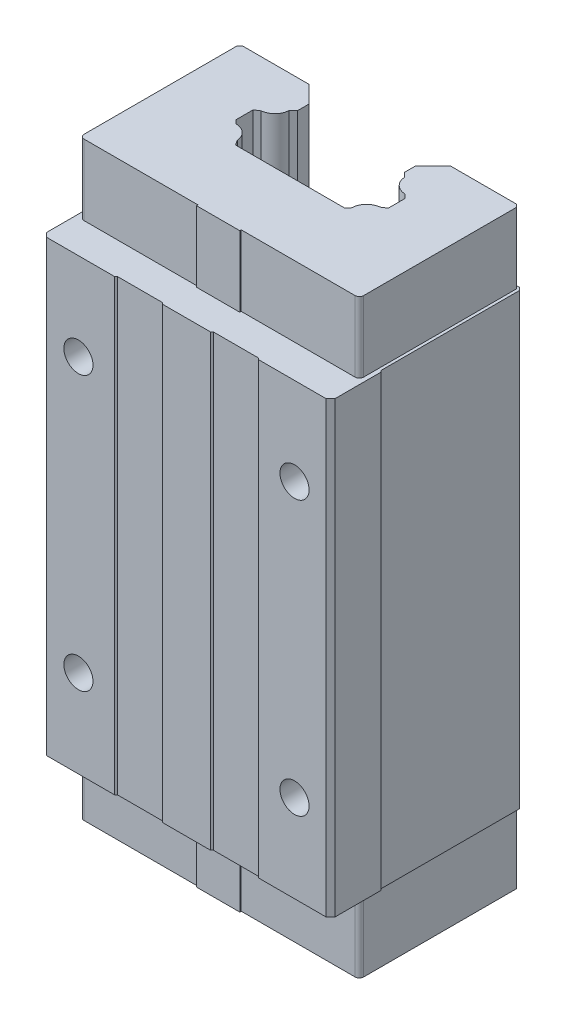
ISO-10303-21;
HEADER;
FILE_DESCRIPTION(('STEP AP214'),'2;1');
FILE_NAME('part.step','',(''),(''),'','','');
FILE_SCHEMA(('AUTOMOTIVE_DESIGN { 1 0 10303 214 1 1 1 1 }'));
ENDSEC;
DATA;
#1=APPLICATION_CONTEXT('core data for automotive mechanical design processes');
#2=APPLICATION_PROTOCOL_DEFINITION('international standard','automotive_design',2000,#1);
#3=PRODUCT_CONTEXT('',#1,'mechanical');
#4=PRODUCT('Part','Part','',(#3));
#5=PRODUCT_RELATED_PRODUCT_CATEGORY('part','',(#4));
#6=PRODUCT_DEFINITION_FORMATION('','',#4);
#7=PRODUCT_DEFINITION_CONTEXT('part definition',#1,'design');
#8=PRODUCT_DEFINITION('design','',#6,#7);
#9=PRODUCT_DEFINITION_SHAPE('','',#8);
#10=(LENGTH_UNIT() NAMED_UNIT(*) SI_UNIT(.MILLI.,.METRE.));
#11=(NAMED_UNIT(*) PLANE_ANGLE_UNIT() SI_UNIT($,.RADIAN.));
#12=(NAMED_UNIT(*) SI_UNIT($,.STERADIAN.) SOLID_ANGLE_UNIT());
#13=UNCERTAINTY_MEASURE_WITH_UNIT(LENGTH_MEASURE(1.E-05),#10,'distance_accuracy_value','');
#14=(GEOMETRIC_REPRESENTATION_CONTEXT(3) GLOBAL_UNCERTAINTY_ASSIGNED_CONTEXT((#13)) GLOBAL_UNIT_ASSIGNED_CONTEXT((#10,
#11,#12)) REPRESENTATION_CONTEXT('',''));
#15=CARTESIAN_POINT('',(0.,0.,0.));
#16=DIRECTION('',(0.,0.,1.));
#17=DIRECTION('',(1.,0.,0.));
#18=AXIS2_PLACEMENT_3D('',#15,#16,#17);
#19=CARTESIAN_POINT('',(0.,77.89,0.));
#20=DIRECTION('',(0.,1.,0.));
#21=DIRECTION('',(1.,0.,0.));
#22=AXIS2_PLACEMENT_3D('',#19,#20,#21);
#23=PLANE('',#22);
#24=DIRECTION('',(-0.707106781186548,0.,0.707106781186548));
#25=VECTOR('',#24,1.);
#26=CARTESIAN_POINT('',(-47.5,77.89,-67.));
#27=LINE('',#26,#25);
#28=CARTESIAN_POINT('',(-47.5,77.89,-67.));
#29=VERTEX_POINT('',#28);
#30=CARTESIAN_POINT('',(-48.5,77.89,-66.));
#31=VERTEX_POINT('',#30);
#32=EDGE_CURVE('E41',#29,#31,#27,.T.);
#33=ORIENTED_EDGE('',*,*,#32,.F.);
#34=DIRECTION('',(1.,0.,0.));
#35=VECTOR('',#34,1.);
#36=CARTESIAN_POINT('',(0.,77.89,-67.));
#37=LINE('',#36,#35);
#38=CARTESIAN_POINT('',(-49.,77.89,-67.));
#39=VERTEX_POINT('',#38);
#40=EDGE_CURVE('E667',#39,#29,#37,.T.);
#41=ORIENTED_EDGE('',*,*,#40,.F.);
#42=DIRECTION('',(0.707106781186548,0.,-0.707106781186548));
#43=VECTOR('',#42,1.);
#44=CARTESIAN_POINT('',(-58.,77.89,-58.));
#45=LINE('',#44,#43);
#46=CARTESIAN_POINT('',(-50.,77.89,-66.));
#47=VERTEX_POINT('',#46);
#48=EDGE_CURVE('E987',#47,#39,#45,.T.);
#49=ORIENTED_EDGE('',*,*,#48,.F.);
#50=DIRECTION('',(0.,0.,-1.));
#51=VECTOR('',#50,1.);
#52=CARTESIAN_POINT('',(-50.,77.89,0.));
#53=LINE('',#52,#51);
#54=CARTESIAN_POINT('',(-50.,77.89,-1.5));
#55=VERTEX_POINT('',#54);
#56=EDGE_CURVE('E508',#55,#47,#53,.T.);
#57=ORIENTED_EDGE('',*,*,#56,.F.);
#58=DIRECTION('',(-0.707106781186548,0.,-0.707106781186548));
#59=VECTOR('',#58,1.);
#60=CARTESIAN_POINT('',(-24.25,77.89,24.25));
#61=LINE('',#60,#59);
#62=CARTESIAN_POINT('',(-48.5,77.89,0.));
#63=VERTEX_POINT('',#62);
#64=EDGE_CURVE('E781',#63,#55,#61,.T.);
#65=ORIENTED_EDGE('',*,*,#64,.F.);
#66=DIRECTION('',(1.,0.,0.));
#67=VECTOR('',#66,1.);
#68=CARTESIAN_POINT('',(-65.,77.89,0.));
#69=LINE('',#68,#67);
#70=CARTESIAN_POINT('',(-25.,77.89,0.));
#71=VERTEX_POINT('',#70);
#72=EDGE_CURVE('E10',#63,#71,#69,.T.);
#73=ORIENTED_EDGE('',*,*,#72,.T.);
#74=DIRECTION('',(-0.707106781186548,0.,0.707106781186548));
#75=VECTOR('',#74,1.);
#76=CARTESIAN_POINT('',(-12.5,77.89,-12.5));
#77=LINE('',#76,#75);
#78=CARTESIAN_POINT('',(-24.5,77.89,-0.5));
#79=VERTEX_POINT('',#78);
#80=EDGE_CURVE('E899',#79,#71,#77,.T.);
#81=ORIENTED_EDGE('',*,*,#80,.F.);
#82=DIRECTION('',(-1.,0.,0.));
#83=VECTOR('',#82,1.);
#84=CARTESIAN_POINT('',(0.,77.89,-0.5));
#85=LINE('',#84,#83);
#86=CARTESIAN_POINT('',(-8.83333333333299,77.89,-0.5));
#87=VERTEX_POINT('',#86);
#88=EDGE_CURVE('E838',#87,#79,#85,.T.);
#89=ORIENTED_EDGE('',*,*,#88,.F.);
#90=DIRECTION('',(-0.70710678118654,0.,-0.707106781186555));
#91=VECTOR('',#90,1.);
#92=CARTESIAN_POINT('',(-4.16666666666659,77.89,4.1666666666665));
#93=LINE('',#92,#91);
#94=CARTESIAN_POINT('',(-8.333333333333,77.89,0.));
#95=VERTEX_POINT('',#94);
#96=EDGE_CURVE('E856',#95,#87,#93,.T.);
#97=ORIENTED_EDGE('',*,*,#96,.F.);
#98=DIRECTION('',(1.,0.,0.));
#99=VECTOR('',#98,1.);
#100=CARTESIAN_POINT('',(-65.,77.89,0.));
#101=LINE('',#100,#99);
#102=CARTESIAN_POINT('',(8.33333333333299,77.89,0.));
#103=VERTEX_POINT('',#102);
#104=EDGE_CURVE('E27',#95,#103,#101,.T.);
#105=ORIENTED_EDGE('',*,*,#104,.T.);
#106=DIRECTION('',(-0.70710678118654,0.,0.707106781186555));
#107=VECTOR('',#106,1.);
#108=CARTESIAN_POINT('',(4.16666666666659,77.89,4.1666666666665));
#109=LINE('',#108,#107);
#110=CARTESIAN_POINT('',(8.83333333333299,77.89,-0.5));
#111=VERTEX_POINT('',#110);
#112=EDGE_CURVE('E647',#111,#103,#109,.T.);
#113=ORIENTED_EDGE('',*,*,#112,.F.);
#114=DIRECTION('',(-1.,0.,0.));
#115=VECTOR('',#114,1.);
#116=CARTESIAN_POINT('',(0.,77.89,-0.5));
#117=LINE('',#116,#115);
#118=CARTESIAN_POINT('',(24.5,77.89,-0.5));
#119=VERTEX_POINT('',#118);
#120=EDGE_CURVE('E683',#119,#111,#117,.T.);
#121=ORIENTED_EDGE('',*,*,#120,.F.);
#122=DIRECTION('',(-0.707106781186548,0.,-0.707106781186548));
#123=VECTOR('',#122,1.);
#124=CARTESIAN_POINT('',(12.5,77.89,-12.5));
#125=LINE('',#124,#123);
#126=CARTESIAN_POINT('',(25.,77.89,0.));
#127=VERTEX_POINT('',#126);
#128=EDGE_CURVE('E801',#127,#119,#125,.T.);
#129=ORIENTED_EDGE('',*,*,#128,.F.);
#130=DIRECTION('',(1.,0.,0.));
#131=VECTOR('',#130,1.);
#132=CARTESIAN_POINT('',(-65.,77.89,0.));
#133=LINE('',#132,#131);
#134=CARTESIAN_POINT('',(48.5,77.89,0.));
#135=VERTEX_POINT('',#134);
#136=EDGE_CURVE('E924',#127,#135,#133,.T.);
#137=ORIENTED_EDGE('',*,*,#136,.T.);
#138=DIRECTION('',(-0.707106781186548,0.,0.707106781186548));
#139=VECTOR('',#138,1.);
#140=CARTESIAN_POINT('',(24.25,77.89,24.25));
#141=LINE('',#140,#139);
#142=CARTESIAN_POINT('',(50.,77.89,-1.5));
#143=VERTEX_POINT('',#142);
#144=EDGE_CURVE('E952',#143,#135,#141,.T.);
#145=ORIENTED_EDGE('',*,*,#144,.F.);
#146=DIRECTION('',(0.,0.,1.));
#147=VECTOR('',#146,1.);
#148=CARTESIAN_POINT('',(50.,77.89,0.));
#149=LINE('',#148,#147);
#150=CARTESIAN_POINT('',(50.,77.89,-17.5));
#151=VERTEX_POINT('',#150);
#152=EDGE_CURVE('E739',#151,#143,#149,.T.);
#153=ORIENTED_EDGE('',*,*,#152,.F.);
#154=DIRECTION('',(0.707106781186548,0.,0.707106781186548));
#155=VECTOR('',#154,1.);
#156=CARTESIAN_POINT('',(33.75,77.89,-33.75));
#157=LINE('',#156,#155);
#158=CARTESIAN_POINT('',(49.5,77.89,-18.));
#159=VERTEX_POINT('',#158);
#160=EDGE_CURVE('E827',#159,#151,#157,.T.);
#161=ORIENTED_EDGE('',*,*,#160,.F.);
#162=DIRECTION('',(0.,0.,1.));
#163=VECTOR('',#162,1.);
#164=CARTESIAN_POINT('',(49.5,77.89,0.));
#165=LINE('',#164,#163);
#166=CARTESIAN_POINT('',(49.5,77.89,-66.));
#167=VERTEX_POINT('',#166);
#168=EDGE_CURVE('E710',#167,#159,#165,.T.);
#169=ORIENTED_EDGE('',*,*,#168,.F.);
#170=DIRECTION('',(0.707106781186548,0.,0.707106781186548));
#171=VECTOR('',#170,1.);
#172=CARTESIAN_POINT('',(57.75,77.89,-57.75));
#173=LINE('',#172,#171);
#174=CARTESIAN_POINT('',(48.5,77.89,-67.));
#175=VERTEX_POINT('',#174);
#176=EDGE_CURVE('E857',#175,#167,#173,.T.);
#177=ORIENTED_EDGE('',*,*,#176,.F.);
#178=DIRECTION('',(1.,0.,0.));
#179=VECTOR('',#178,1.);
#180=CARTESIAN_POINT('',(4.06792655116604E-12,77.89,-67.0000000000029));
#181=LINE('',#180,#179);
#182=CARTESIAN_POINT('',(47.5,77.89,-67.));
#183=VERTEX_POINT('',#182);
#184=EDGE_CURVE('E605',#183,#175,#181,.T.);
#185=ORIENTED_EDGE('',*,*,#184,.F.);
#186=DIRECTION('',(-0.707106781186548,0.,-0.707106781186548));
#187=VECTOR('',#186,1.);
#188=CARTESIAN_POINT('',(48.5,77.89,-66.));
#189=LINE('',#188,#187);
#190=CARTESIAN_POINT('',(48.5,77.89,-66.));
#191=VERTEX_POINT('',#190);
#192=EDGE_CURVE('E894',#191,#183,#189,.T.);
#193=ORIENTED_EDGE('',*,*,#192,.F.);
#194=DIRECTION('',(0.,0.,-1.));
#195=VECTOR('',#194,1.);
#196=CARTESIAN_POINT('',(48.5,77.89,-13.));
#197=LINE('',#196,#195);
#198=CARTESIAN_POINT('',(48.5,77.89,-13.));
#199=VERTEX_POINT('',#198);
#200=EDGE_CURVE('E986',#199,#191,#197,.T.);
#201=ORIENTED_EDGE('',*,*,#200,.F.);
#202=CARTESIAN_POINT('',(47.,77.89,-13.));
#203=DIRECTION('',(0.,1.,0.));
#204=DIRECTION('',(-1.,0.,0.));
#205=AXIS2_PLACEMENT_3D('',#202,#203,#204);
#206=CIRCLE('',#205,1.5);
#207=CARTESIAN_POINT('',(47.,77.89,-11.5));
#208=VERTEX_POINT('',#207);
#209=EDGE_CURVE('E1076',#208,#199,#206,.T.);
#210=ORIENTED_EDGE('',*,*,#209,.F.);
#211=DIRECTION('',(1.,0.,0.));
#212=VECTOR('',#211,1.);
#213=CARTESIAN_POINT('',(7.5,77.89,-11.5));
#214=LINE('',#213,#212);
#215=CARTESIAN_POINT('',(7.5,77.89,-11.5));
#216=VERTEX_POINT('',#215);
#217=EDGE_CURVE('E790',#216,#208,#214,.T.);
#218=ORIENTED_EDGE('',*,*,#217,.F.);
#219=DIRECTION('',(0.,0.,-1.));
#220=VECTOR('',#219,1.);
#221=CARTESIAN_POINT('',(7.5,77.89,-11.));
#222=LINE('',#221,#220);
#223=CARTESIAN_POINT('',(7.5,77.89,-11.));
#224=VERTEX_POINT('',#223);
#225=EDGE_CURVE('E789',#224,#216,#222,.T.);
#226=ORIENTED_EDGE('',*,*,#225,.F.);
#227=DIRECTION('',(1.,0.,0.));
#228=VECTOR('',#227,1.);
#229=CARTESIAN_POINT('',(-7.5,77.89,-11.));
#230=LINE('',#229,#228);
#231=CARTESIAN_POINT('',(-7.5,77.89,-11.));
#232=VERTEX_POINT('',#231);
#233=EDGE_CURVE('E814',#232,#224,#230,.T.);
#234=ORIENTED_EDGE('',*,*,#233,.F.);
#235=DIRECTION('',(0.,0.,1.));
#236=VECTOR('',#235,1.);
#237=CARTESIAN_POINT('',(-7.5,77.89,-11.5));
#238=LINE('',#237,#236);
#239=CARTESIAN_POINT('',(-7.5,77.89,-11.5));
#240=VERTEX_POINT('',#239);
#241=EDGE_CURVE('E878',#240,#232,#238,.T.);
#242=ORIENTED_EDGE('',*,*,#241,.F.);
#243=DIRECTION('',(1.,0.,0.));
#244=VECTOR('',#243,1.);
#245=CARTESIAN_POINT('',(-47.,77.89,-11.5));
#246=LINE('',#245,#244);
#247=CARTESIAN_POINT('',(-47.,77.89,-11.5));
#248=VERTEX_POINT('',#247);
#249=EDGE_CURVE('E873',#248,#240,#246,.T.);
#250=ORIENTED_EDGE('',*,*,#249,.F.);
#251=CARTESIAN_POINT('',(-47.,77.89,-13.));
#252=DIRECTION('',(0.,1.,0.));
#253=DIRECTION('',(1.,0.,0.));
#254=AXIS2_PLACEMENT_3D('',#251,#252,#253);
#255=CIRCLE('',#254,1.5);
#256=CARTESIAN_POINT('',(-48.5,77.89,-13.));
#257=VERTEX_POINT('',#256);
#258=EDGE_CURVE('E872',#257,#248,#255,.T.);
#259=ORIENTED_EDGE('',*,*,#258,.F.);
#260=DIRECTION('',(0.,0.,1.));
#261=VECTOR('',#260,1.);
#262=CARTESIAN_POINT('',(-48.5,77.89,-66.));
#263=LINE('',#262,#261);
#264=EDGE_CURVE('E734',#31,#257,#263,.T.);
#265=ORIENTED_EDGE('',*,*,#264,.F.);
#266=EDGE_LOOP('',(#33,#41,#49,#57,#65,#73,#81,#89,#97,#105,#113,#121,#129,#137,#145,#153,#161,
#169,#177,#185,#193,#201,#210,#218,#226,#234,#242,#250,#259,#265));
#267=FACE_BOUND('',#266,.T.);
#268=ADVANCED_FACE('F16',(#267),#23,.T.);
#269=CARTESIAN_POINT('',(-65.,-77.89,0.));
#270=DIRECTION('',(0.,0.,1.));
#271=DIRECTION('',(1.,0.,0.));
#272=AXIS2_PLACEMENT_3D('',#269,#270,#271);
#273=PLANE('',#272);
#274=CARTESIAN_POINT('',(-37.5,47.5,0.));
#275=DIRECTION('',(0.,0.,-1.));
#276=DIRECTION('',(0.,-1.,0.));
#277=AXIS2_PLACEMENT_3D('',#274,#275,#276);
#278=CIRCLE('',#277,5.053);
#279=CARTESIAN_POINT('',(-37.5,42.447,0.));
#280=VERTEX_POINT('',#279);
#281=EDGE_CURVE('E928',#280,#280,#278,.T.);
#282=ORIENTED_EDGE('',*,*,#281,.T.);
#283=EDGE_LOOP('',(#282));
#284=FACE_BOUND('',#283,.T.);
#285=CARTESIAN_POINT('',(-37.5,-47.5,0.));
#286=DIRECTION('',(0.,0.,-1.));
#287=DIRECTION('',(0.,-1.,0.));
#288=AXIS2_PLACEMENT_3D('',#285,#286,#287);
#289=CIRCLE('',#288,5.053);
#290=CARTESIAN_POINT('',(-37.5,-52.553,0.));
#291=VERTEX_POINT('',#290);
#292=EDGE_CURVE('E1178',#291,#291,#289,.T.);
#293=ORIENTED_EDGE('',*,*,#292,.T.);
#294=EDGE_LOOP('',(#293));
#295=FACE_BOUND('',#294,.T.);
#296=DIRECTION('',(0.,1.,0.));
#297=VECTOR('',#296,1.);
#298=CARTESIAN_POINT('',(-25.,-218.099537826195,0.));
#299=LINE('',#298,#297);
#300=CARTESIAN_POINT('',(-25.,-77.89,0.));
#301=VERTEX_POINT('',#300);
#302=EDGE_CURVE('E915',#301,#71,#299,.T.);
#303=ORIENTED_EDGE('',*,*,#302,.T.);
#304=ORIENTED_EDGE('',*,*,#72,.F.);
#305=DIRECTION('',(0.,1.,0.));
#306=VECTOR('',#305,1.);
#307=CARTESIAN_POINT('',(-48.5,-218.099537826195,0.));
#308=LINE('',#307,#306);
#309=CARTESIAN_POINT('',(-48.5,-77.89,0.));
#310=VERTEX_POINT('',#309);
#311=EDGE_CURVE('E777',#310,#63,#308,.T.);
#312=ORIENTED_EDGE('',*,*,#311,.F.);
#313=DIRECTION('',(1.,0.,0.));
#314=VECTOR('',#313,1.);
#315=CARTESIAN_POINT('',(-65.,-77.89,0.));
#316=LINE('',#315,#314);
#317=EDGE_CURVE('E912',#310,#301,#316,.T.);
#318=ORIENTED_EDGE('',*,*,#317,.T.);
#319=EDGE_LOOP('',(#303,#304,#312,#318));
#320=FACE_BOUND('',#319,.T.);
#321=ADVANCED_FACE('F1353',(#284,#295,#320),#273,.T.);
#322=CARTESIAN_POINT('',(-65.,-77.89,0.));
#323=DIRECTION('',(0.,0.,1.));
#324=DIRECTION('',(1.,0.,0.));
#325=AXIS2_PLACEMENT_3D('',#322,#323,#324);
#326=PLANE('',#325);
#327=DIRECTION('',(0.,1.,0.));
#328=VECTOR('',#327,1.);
#329=CARTESIAN_POINT('',(8.333333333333,-218.099537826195,0.));
#330=LINE('',#329,#328);
#331=CARTESIAN_POINT('',(8.333333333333,-77.89,0.));
#332=VERTEX_POINT('',#331);
#333=EDGE_CURVE('E916',#332,#103,#330,.T.);
#334=ORIENTED_EDGE('',*,*,#333,.T.);
#335=ORIENTED_EDGE('',*,*,#104,.F.);
#336=DIRECTION('',(0.,1.,0.));
#337=VECTOR('',#336,1.);
#338=CARTESIAN_POINT('',(-8.333333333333,-218.099537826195,0.));
#339=LINE('',#338,#337);
#340=CARTESIAN_POINT('',(-8.333333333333,-77.89,0.));
#341=VERTEX_POINT('',#340);
#342=EDGE_CURVE('E711',#341,#95,#339,.T.);
#343=ORIENTED_EDGE('',*,*,#342,.F.);
#344=DIRECTION('',(1.,0.,0.));
#345=VECTOR('',#344,1.);
#346=CARTESIAN_POINT('',(-65.,-77.89,0.));
#347=LINE('',#346,#345);
#348=EDGE_CURVE('E1136',#341,#332,#347,.T.);
#349=ORIENTED_EDGE('',*,*,#348,.T.);
#350=EDGE_LOOP('',(#334,#335,#343,#349));
#351=FACE_BOUND('',#350,.T.);
#352=ADVANCED_FACE('F2094',(#351),#326,.T.);
#353=CARTESIAN_POINT('',(-65.,-77.89,0.));
#354=DIRECTION('',(0.,0.,1.));
#355=DIRECTION('',(1.,0.,0.));
#356=AXIS2_PLACEMENT_3D('',#353,#354,#355);
#357=PLANE('',#356);
#358=CARTESIAN_POINT('',(37.5,47.5,0.));
#359=DIRECTION('',(0.,0.,-1.));
#360=DIRECTION('',(0.,-1.,0.));
#361=AXIS2_PLACEMENT_3D('',#358,#359,#360);
#362=CIRCLE('',#361,5.053);
#363=CARTESIAN_POINT('',(37.5,42.447,0.));
#364=VERTEX_POINT('',#363);
#365=EDGE_CURVE('E677',#364,#364,#362,.T.);
#366=ORIENTED_EDGE('',*,*,#365,.T.);
#367=EDGE_LOOP('',(#366));
#368=FACE_BOUND('',#367,.T.);
#369=CARTESIAN_POINT('',(37.5,-47.5,0.));
#370=DIRECTION('',(0.,0.,-1.));
#371=DIRECTION('',(0.,-1.,0.));
#372=AXIS2_PLACEMENT_3D('',#369,#370,#371);
#373=CIRCLE('',#372,5.053);
#374=CARTESIAN_POINT('',(37.5,-52.553,0.));
#375=VERTEX_POINT('',#374);
#376=EDGE_CURVE('E673',#375,#375,#373,.T.);
#377=ORIENTED_EDGE('',*,*,#376,.T.);
#378=EDGE_LOOP('',(#377));
#379=FACE_BOUND('',#378,.T.);
#380=DIRECTION('',(0.,1.,0.));
#381=VECTOR('',#380,1.);
#382=CARTESIAN_POINT('',(48.5,-218.099537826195,0.));
#383=LINE('',#382,#381);
#384=CARTESIAN_POINT('',(48.5,-77.89,0.));
#385=VERTEX_POINT('',#384);
#386=EDGE_CURVE('E678',#385,#135,#383,.T.);
#387=ORIENTED_EDGE('',*,*,#386,.T.);
#388=ORIENTED_EDGE('',*,*,#136,.F.);
#389=DIRECTION('',(0.,1.,0.));
#390=VECTOR('',#389,1.);
#391=CARTESIAN_POINT('',(25.,-218.099537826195,0.));
#392=LINE('',#391,#390);
#393=CARTESIAN_POINT('',(25.,-77.89,0.));
#394=VERTEX_POINT('',#393);
#395=EDGE_CURVE('E684',#394,#127,#392,.T.);
#396=ORIENTED_EDGE('',*,*,#395,.F.);
#397=DIRECTION('',(1.,0.,0.));
#398=VECTOR('',#397,1.);
#399=CARTESIAN_POINT('',(-65.,-77.89,0.));
#400=LINE('',#399,#398);
#401=EDGE_CURVE('E712',#394,#385,#400,.T.);
#402=ORIENTED_EDGE('',*,*,#401,.T.);
#403=EDGE_LOOP('',(#387,#388,#396,#402));
#404=FACE_BOUND('',#403,.T.);
#405=ADVANCED_FACE('F2037',(#368,#379,#404),#357,.T.);
#406=CARTESIAN_POINT('',(0.,-77.89,0.));
#407=DIRECTION('',(0.,1.,0.));
#408=DIRECTION('',(1.,0.,0.));
#409=AXIS2_PLACEMENT_3D('',#406,#407,#408);
#410=PLANE('',#409);
#411=DIRECTION('',(0.707106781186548,0.,0.707106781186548));
#412=VECTOR('',#411,1.);
#413=CARTESIAN_POINT('',(47.5,-77.89,-67.));
#414=LINE('',#413,#412);
#415=CARTESIAN_POINT('',(47.5,-77.89,-67.));
#416=VERTEX_POINT('',#415);
#417=CARTESIAN_POINT('',(48.5,-77.89,-66.));
#418=VERTEX_POINT('',#417);
#419=EDGE_CURVE('E797',#416,#418,#414,.T.);
#420=ORIENTED_EDGE('',*,*,#419,.F.);
#421=DIRECTION('',(-1.,0.,0.));
#422=VECTOR('',#421,1.);
#423=CARTESIAN_POINT('',(4.06792655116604E-12,-77.89,-67.0000000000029));
#424=LINE('',#423,#422);
#425=CARTESIAN_POINT('',(48.5,-77.89,-67.));
#426=VERTEX_POINT('',#425);
#427=EDGE_CURVE('E809',#426,#416,#424,.T.);
#428=ORIENTED_EDGE('',*,*,#427,.F.);
#429=DIRECTION('',(-0.707106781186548,0.,-0.707106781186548));
#430=VECTOR('',#429,1.);
#431=CARTESIAN_POINT('',(57.75,-77.89,-57.75));
#432=LINE('',#431,#430);
#433=CARTESIAN_POINT('',(49.5,-77.89,-66.));
#434=VERTEX_POINT('',#433);
#435=EDGE_CURVE('E948',#434,#426,#432,.T.);
#436=ORIENTED_EDGE('',*,*,#435,.F.);
#437=DIRECTION('',(0.,0.,-1.));
#438=VECTOR('',#437,1.);
#439=CARTESIAN_POINT('',(49.5,-77.89,0.));
#440=LINE('',#439,#438);
#441=CARTESIAN_POINT('',(49.5,-77.89,-18.));
#442=VERTEX_POINT('',#441);
#443=EDGE_CURVE('E765',#442,#434,#440,.T.);
#444=ORIENTED_EDGE('',*,*,#443,.F.);
#445=DIRECTION('',(-0.707106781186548,0.,-0.707106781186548));
#446=VECTOR('',#445,1.);
#447=CARTESIAN_POINT('',(33.75,-77.89,-33.75));
#448=LINE('',#447,#446);
#449=CARTESIAN_POINT('',(50.,-77.89,-17.5));
#450=VERTEX_POINT('',#449);
#451=EDGE_CURVE('E735',#450,#442,#448,.T.);
#452=ORIENTED_EDGE('',*,*,#451,.F.);
#453=DIRECTION('',(0.,0.,-1.));
#454=VECTOR('',#453,1.);
#455=CARTESIAN_POINT('',(50.,-77.89,0.));
#456=LINE('',#455,#454);
#457=CARTESIAN_POINT('',(50.,-77.89,-1.5));
#458=VERTEX_POINT('',#457);
#459=EDGE_CURVE('E668',#458,#450,#456,.T.);
#460=ORIENTED_EDGE('',*,*,#459,.F.);
#461=DIRECTION('',(0.707106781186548,0.,-0.707106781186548));
#462=VECTOR('',#461,1.);
#463=CARTESIAN_POINT('',(24.25,-77.89,24.25));
#464=LINE('',#463,#462);
#465=EDGE_CURVE('E622',#385,#458,#464,.T.);
#466=ORIENTED_EDGE('',*,*,#465,.F.);
#467=ORIENTED_EDGE('',*,*,#401,.F.);
#468=DIRECTION('',(0.707106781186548,0.,0.707106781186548));
#469=VECTOR('',#468,1.);
#470=CARTESIAN_POINT('',(12.5,-77.89,-12.5));
#471=LINE('',#470,#469);
#472=CARTESIAN_POINT('',(24.5,-77.89,-0.5));
#473=VERTEX_POINT('',#472);
#474=EDGE_CURVE('E679',#473,#394,#471,.T.);
#475=ORIENTED_EDGE('',*,*,#474,.F.);
#476=DIRECTION('',(1.,0.,0.));
#477=VECTOR('',#476,1.);
#478=CARTESIAN_POINT('',(0.,-77.89,-0.5));
#479=LINE('',#478,#477);
#480=CARTESIAN_POINT('',(8.83333333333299,-77.89,-0.5));
#481=VERTEX_POINT('',#480);
#482=EDGE_CURVE('E651',#481,#473,#479,.T.);
#483=ORIENTED_EDGE('',*,*,#482,.F.);
#484=DIRECTION('',(0.70710678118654,0.,-0.707106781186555));
#485=VECTOR('',#484,1.);
#486=CARTESIAN_POINT('',(4.16666666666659,-77.89,4.1666666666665));
#487=LINE('',#486,#485);
#488=EDGE_CURVE('E842',#332,#481,#487,.T.);
#489=ORIENTED_EDGE('',*,*,#488,.F.);
#490=ORIENTED_EDGE('',*,*,#348,.F.);
#491=DIRECTION('',(0.70710678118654,0.,0.707106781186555));
#492=VECTOR('',#491,1.);
#493=CARTESIAN_POINT('',(-4.16666666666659,-77.89,4.1666666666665));
#494=LINE('',#493,#492);
#495=CARTESIAN_POINT('',(-8.83333333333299,-77.89,-0.5));
#496=VERTEX_POINT('',#495);
#497=EDGE_CURVE('E706',#496,#341,#494,.T.);
#498=ORIENTED_EDGE('',*,*,#497,.F.);
#499=DIRECTION('',(1.,0.,0.));
#500=VECTOR('',#499,1.);
#501=CARTESIAN_POINT('',(0.,-77.89,-0.5));
#502=LINE('',#501,#500);
#503=CARTESIAN_POINT('',(-24.5,-77.89,-0.5));
#504=VERTEX_POINT('',#503);
#505=EDGE_CURVE('E903',#504,#496,#502,.T.);
#506=ORIENTED_EDGE('',*,*,#505,.F.);
#507=DIRECTION('',(0.707106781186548,0.,-0.707106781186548));
#508=VECTOR('',#507,1.);
#509=CARTESIAN_POINT('',(-12.5,-77.89,-12.5));
#510=LINE('',#509,#508);
#511=EDGE_CURVE('E944',#301,#504,#510,.T.);
#512=ORIENTED_EDGE('',*,*,#511,.F.);
#513=ORIENTED_EDGE('',*,*,#317,.F.);
#514=DIRECTION('',(0.707106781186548,0.,0.707106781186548));
#515=VECTOR('',#514,1.);
#516=CARTESIAN_POINT('',(-24.25,-77.89,24.25));
#517=LINE('',#516,#515);
#518=CARTESIAN_POINT('',(-50.,-77.89,-1.5));
#519=VERTEX_POINT('',#518);
#520=EDGE_CURVE('E715',#519,#310,#517,.T.);
#521=ORIENTED_EDGE('',*,*,#520,.F.);
#522=DIRECTION('',(0.,0.,1.));
#523=VECTOR('',#522,1.);
#524=CARTESIAN_POINT('',(-50.,-77.89,0.));
#525=LINE('',#524,#523);
#526=CARTESIAN_POINT('',(-50.,-77.89,-66.));
#527=VERTEX_POINT('',#526);
#528=EDGE_CURVE('E990',#527,#519,#525,.T.);
#529=ORIENTED_EDGE('',*,*,#528,.F.);
#530=DIRECTION('',(-0.707106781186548,0.,0.707106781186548));
#531=VECTOR('',#530,1.);
#532=CARTESIAN_POINT('',(-58.,-77.89,-58.));
#533=LINE('',#532,#531);
#534=CARTESIAN_POINT('',(-49.,-77.89,-67.));
#535=VERTEX_POINT('',#534);
#536=EDGE_CURVE('E796',#535,#527,#533,.T.);
#537=ORIENTED_EDGE('',*,*,#536,.F.);
#538=DIRECTION('',(-1.,0.,0.));
#539=VECTOR('',#538,1.);
#540=CARTESIAN_POINT('',(0.,-77.89,-67.));
#541=LINE('',#540,#539);
#542=CARTESIAN_POINT('',(-47.5,-77.89,-67.));
#543=VERTEX_POINT('',#542);
#544=EDGE_CURVE('E666',#543,#535,#541,.T.);
#545=ORIENTED_EDGE('',*,*,#544,.F.);
#546=DIRECTION('',(0.707106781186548,0.,-0.707106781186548));
#547=VECTOR('',#546,1.);
#548=CARTESIAN_POINT('',(-48.5,-77.89,-66.));
#549=LINE('',#548,#547);
#550=CARTESIAN_POINT('',(-48.5,-77.89,-66.));
#551=VERTEX_POINT('',#550);
#552=EDGE_CURVE('E770',#551,#543,#549,.T.);
#553=ORIENTED_EDGE('',*,*,#552,.F.);
#554=DIRECTION('',(0.,0.,-1.));
#555=VECTOR('',#554,1.);
#556=CARTESIAN_POINT('',(-48.5,-77.89,-13.));
#557=LINE('',#556,#555);
#558=CARTESIAN_POINT('',(-48.5,-77.89,-13.));
#559=VERTEX_POINT('',#558);
#560=EDGE_CURVE('E689',#559,#551,#557,.T.);
#561=ORIENTED_EDGE('',*,*,#560,.F.);
#562=CARTESIAN_POINT('',(-47.,-77.89,-13.));
#563=DIRECTION('',(0.,-1.,0.));
#564=DIRECTION('',(1.,0.,0.));
#565=AXIS2_PLACEMENT_3D('',#562,#563,#564);
#566=CIRCLE('',#565,1.5);
#567=CARTESIAN_POINT('',(-47.,-77.89,-11.5));
#568=VERTEX_POINT('',#567);
#569=EDGE_CURVE('E749',#568,#559,#566,.T.);
#570=ORIENTED_EDGE('',*,*,#569,.F.);
#571=DIRECTION('',(-1.,0.,0.));
#572=VECTOR('',#571,1.);
#573=CARTESIAN_POINT('',(-7.5,-77.89,-11.5));
#574=LINE('',#573,#572);
#575=CARTESIAN_POINT('',(-7.5,-77.89,-11.5));
#576=VERTEX_POINT('',#575);
#577=EDGE_CURVE('E755',#576,#568,#574,.T.);
#578=ORIENTED_EDGE('',*,*,#577,.F.);
#579=DIRECTION('',(0.,0.,-1.));
#580=VECTOR('',#579,1.);
#581=CARTESIAN_POINT('',(-7.5,-77.89,-11.));
#582=LINE('',#581,#580);
#583=CARTESIAN_POINT('',(-7.5,-77.89,-11.));
#584=VERTEX_POINT('',#583);
#585=EDGE_CURVE('E1048',#584,#576,#582,.T.);
#586=ORIENTED_EDGE('',*,*,#585,.F.);
#587=DIRECTION('',(-1.,0.,0.));
#588=VECTOR('',#587,1.);
#589=CARTESIAN_POINT('',(7.5,-77.89,-11.));
#590=LINE('',#589,#588);
#591=CARTESIAN_POINT('',(7.5,-77.89,-11.));
#592=VERTEX_POINT('',#591);
#593=EDGE_CURVE('E629',#592,#584,#590,.T.);
#594=ORIENTED_EDGE('',*,*,#593,.F.);
#595=DIRECTION('',(0.,0.,1.));
#596=VECTOR('',#595,1.);
#597=CARTESIAN_POINT('',(7.5,-77.89,-11.5));
#598=LINE('',#597,#596);
#599=CARTESIAN_POINT('',(7.5,-77.89,-11.5));
#600=VERTEX_POINT('',#599);
#601=EDGE_CURVE('E657',#600,#592,#598,.T.);
#602=ORIENTED_EDGE('',*,*,#601,.F.);
#603=DIRECTION('',(-1.,0.,0.));
#604=VECTOR('',#603,1.);
#605=CARTESIAN_POINT('',(47.,-77.89,-11.5));
#606=LINE('',#605,#604);
#607=CARTESIAN_POINT('',(47.,-77.89,-11.5));
#608=VERTEX_POINT('',#607);
#609=EDGE_CURVE('E815',#608,#600,#606,.T.);
#610=ORIENTED_EDGE('',*,*,#609,.F.);
#611=CARTESIAN_POINT('',(47.,-77.89,-13.));
#612=DIRECTION('',(0.,-1.,0.));
#613=DIRECTION('',(1.,0.,0.));
#614=AXIS2_PLACEMENT_3D('',#611,#612,#613);
#615=CIRCLE('',#614,1.5);
#616=CARTESIAN_POINT('',(48.5,-77.89,-13.));
#617=VERTEX_POINT('',#616);
#618=EDGE_CURVE('E833',#617,#608,#615,.T.);
#619=ORIENTED_EDGE('',*,*,#618,.F.);
#620=DIRECTION('',(0.,0.,1.));
#621=VECTOR('',#620,1.);
#622=CARTESIAN_POINT('',(48.5,-77.89,-66.));
#623=LINE('',#622,#621);
#624=EDGE_CURVE('E920',#418,#617,#623,.T.);
#625=ORIENTED_EDGE('',*,*,#624,.F.);
#626=EDGE_LOOP('',(#420,#428,#436,#444,#452,#460,#466,#467,#475,#483,#489,#490,#498,#506,#512,
#513,#521,#529,#537,#545,#553,#561,#570,#578,#586,#594,#602,#610,#619,#625));
#627=FACE_BOUND('',#626,.T.);
#628=ADVANCED_FACE('F1361',(#627),#410,.F.);
#629=CARTESIAN_POINT('',(-48.5,-218.099537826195,0.));
#630=DIRECTION('',(-0.707106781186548,0.,0.707106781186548));
#631=DIRECTION('',(0.,1.,0.));
#632=AXIS2_PLACEMENT_3D('',#629,#630,#631);
#633=PLANE('',#632);
#634=ORIENTED_EDGE('',*,*,#520,.T.);
#635=ORIENTED_EDGE('',*,*,#311,.T.);
#636=ORIENTED_EDGE('',*,*,#64,.T.);
#637=DIRECTION('',(0.,1.,0.));
#638=VECTOR('',#637,1.);
#639=CARTESIAN_POINT('',(-50.,-218.099537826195,-1.5));
#640=LINE('',#639,#638);
#641=EDGE_CURVE('E849',#519,#55,#640,.T.);
#642=ORIENTED_EDGE('',*,*,#641,.F.);
#643=EDGE_LOOP('',(#634,#635,#636,#642));
#644=FACE_BOUND('',#643,.T.);
#645=ADVANCED_FACE('F1371',(#644),#633,.T.);
#646=CARTESIAN_POINT('',(50.,-218.099537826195,-1.5));
#647=DIRECTION('',(0.707106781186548,0.,0.707106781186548));
#648=DIRECTION('',(0.,-1.,0.));
#649=AXIS2_PLACEMENT_3D('',#646,#647,#648);
#650=PLANE('',#649);
#651=ORIENTED_EDGE('',*,*,#465,.T.);
#652=DIRECTION('',(0.,1.,0.));
#653=VECTOR('',#652,1.);
#654=CARTESIAN_POINT('',(50.,-218.099537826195,-1.5));
#655=LINE('',#654,#653);
#656=EDGE_CURVE('E1080',#458,#143,#655,.T.);
#657=ORIENTED_EDGE('',*,*,#656,.T.);
#658=ORIENTED_EDGE('',*,*,#144,.T.);
#659=ORIENTED_EDGE('',*,*,#386,.F.);
#660=EDGE_LOOP('',(#651,#657,#658,#659));
#661=FACE_BOUND('',#660,.T.);
#662=ADVANCED_FACE('F1675',(#661),#650,.T.);
#663=CARTESIAN_POINT('',(48.5,-218.099537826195,-67.));
#664=DIRECTION('',(0.707106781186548,0.,-0.707106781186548));
#665=DIRECTION('',(0.,-1.,0.));
#666=AXIS2_PLACEMENT_3D('',#663,#664,#665);
#667=PLANE('',#666);
#668=ORIENTED_EDGE('',*,*,#435,.T.);
#669=DIRECTION('',(0.,1.,0.));
#670=VECTOR('',#669,1.);
#671=CARTESIAN_POINT('',(48.5,-218.099537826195,-67.));
#672=LINE('',#671,#670);
#673=EDGE_CURVE('E861',#426,#175,#672,.T.);
#674=ORIENTED_EDGE('',*,*,#673,.T.);
#675=ORIENTED_EDGE('',*,*,#176,.T.);
#676=DIRECTION('',(0.,1.,0.));
#677=VECTOR('',#676,1.);
#678=CARTESIAN_POINT('',(49.5,-218.099537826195,-66.));
#679=LINE('',#678,#677);
#680=EDGE_CURVE('E761',#434,#167,#679,.T.);
#681=ORIENTED_EDGE('',*,*,#680,.F.);
#682=EDGE_LOOP('',(#668,#674,#675,#681));
#683=FACE_BOUND('',#682,.T.);
#684=ADVANCED_FACE('F1662',(#683),#667,.T.);
#685=CARTESIAN_POINT('',(48.5,-218.099537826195,-67.));
#686=DIRECTION('',(0.,0.,-1.));
#687=DIRECTION('',(0.,-1.,0.));
#688=AXIS2_PLACEMENT_3D('',#685,#686,#687);
#689=PLANE('',#688);
#690=ORIENTED_EDGE('',*,*,#427,.T.);
#691=DIRECTION('',(0.,1.,0.));
#692=VECTOR('',#691,1.);
#693=CARTESIAN_POINT('',(47.5,-102.4,-67.));
#694=LINE('',#693,#692);
#695=CARTESIAN_POINT('',(47.5,-102.4,-67.));
#696=VERTEX_POINT('',#695);
#697=EDGE_CURVE('E802',#696,#416,#694,.T.);
#698=ORIENTED_EDGE('',*,*,#697,.F.);
#699=DIRECTION('',(1.,0.,0.));
#700=VECTOR('',#699,1.);
#701=CARTESIAN_POINT('',(24.5000000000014,-102.4,-67.0000000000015));
#702=LINE('',#701,#700);
#703=CARTESIAN_POINT('',(24.5000000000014,-102.4,-67.0000000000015));
#704=VERTEX_POINT('',#703);
#705=EDGE_CURVE('E1009',#704,#696,#702,.T.);
#706=ORIENTED_EDGE('',*,*,#705,.F.);
#707=DIRECTION('',(0.,1.,0.));
#708=VECTOR('',#707,1.);
#709=CARTESIAN_POINT('',(24.5000000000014,-218.099537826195,-67.0000000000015));
#710=LINE('',#709,#708);
#711=CARTESIAN_POINT('',(24.5000000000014,102.4,-67.0000000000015));
#712=VERTEX_POINT('',#711);
#713=EDGE_CURVE('E806',#704,#712,#710,.T.);
#714=ORIENTED_EDGE('',*,*,#713,.T.);
#715=DIRECTION('',(-1.,0.,0.));
#716=VECTOR('',#715,1.);
#717=CARTESIAN_POINT('',(47.5,102.4,-67.));
#718=LINE('',#717,#716);
#719=CARTESIAN_POINT('',(47.5,102.4,-67.));
#720=VERTEX_POINT('',#719);
#721=EDGE_CURVE('E591',#720,#712,#718,.T.);
#722=ORIENTED_EDGE('',*,*,#721,.F.);
#723=DIRECTION('',(0.,-1.,0.));
#724=VECTOR('',#723,1.);
#725=CARTESIAN_POINT('',(47.5,102.4,-67.));
#726=LINE('',#725,#724);
#727=EDGE_CURVE('E723',#720,#183,#726,.T.);
#728=ORIENTED_EDGE('',*,*,#727,.T.);
#729=ORIENTED_EDGE('',*,*,#184,.T.);
#730=ORIENTED_EDGE('',*,*,#673,.F.);
#731=EDGE_LOOP('',(#690,#698,#706,#714,#722,#728,#729,#730));
#732=FACE_BOUND('',#731,.T.);
#733=ADVANCED_FACE('F1658',(#732),#689,.T.);
#734=CARTESIAN_POINT('',(24.5000000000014,-218.099537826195,-67.0000000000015));
#735=DIRECTION('',(-0.707106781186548,0.,-0.707106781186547));
#736=DIRECTION('',(-0.707106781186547,0.,0.707106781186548));
#737=AXIS2_PLACEMENT_3D('',#734,#735,#736);
#738=PLANE('',#737);
#739=ORIENTED_EDGE('',*,*,#713,.F.);
#740=DIRECTION('',(0.707106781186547,0.,-0.707106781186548));
#741=VECTOR('',#740,1.);
#742=CARTESIAN_POINT('',(18.5500000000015,-102.4,-61.0500000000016));
#743=LINE('',#742,#741);
#744=CARTESIAN_POINT('',(18.5500000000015,-102.4,-61.0500000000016));
#745=VERTEX_POINT('',#744);
#746=EDGE_CURVE('E601',#745,#704,#743,.T.);
#747=ORIENTED_EDGE('',*,*,#746,.F.);
#748=DIRECTION('',(0.,1.,0.));
#749=VECTOR('',#748,1.);
#750=CARTESIAN_POINT('',(18.5500000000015,-218.099537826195,-61.0500000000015));
#751=LINE('',#750,#749);
#752=CARTESIAN_POINT('',(18.5500000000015,102.4,-61.0500000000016));
#753=VERTEX_POINT('',#752);
#754=EDGE_CURVE('E598',#745,#753,#751,.T.);
#755=ORIENTED_EDGE('',*,*,#754,.T.);
#756=DIRECTION('',(-0.707106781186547,0.,0.707106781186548));
#757=VECTOR('',#756,1.);
#758=CARTESIAN_POINT('',(24.5000000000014,102.4,-67.0000000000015));
#759=LINE('',#758,#757);
#760=EDGE_CURVE('E584',#712,#753,#759,.T.);
#761=ORIENTED_EDGE('',*,*,#760,.F.);
#762=EDGE_LOOP('',(#739,#747,#755,#761));
#763=FACE_BOUND('',#762,.T.);
#764=ADVANCED_FACE('F599',(#763),#738,.T.);
#765=CARTESIAN_POINT('',(18.5500000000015,-218.099537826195,-61.0500000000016));
#766=DIRECTION('',(-1.,0.,0.));
#767=DIRECTION('',(0.,0.,1.));
#768=AXIS2_PLACEMENT_3D('',#765,#766,#767);
#769=PLANE('',#768);
#770=ORIENTED_EDGE('',*,*,#754,.F.);
#771=DIRECTION('',(0.,0.,-1.));
#772=VECTOR('',#771,1.);
#773=CARTESIAN_POINT('',(18.5500000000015,-102.4,-57.1500000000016));
#774=LINE('',#773,#772);
#775=CARTESIAN_POINT('',(18.5500000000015,-102.4,-57.1500000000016));
#776=VERTEX_POINT('',#775);
#777=EDGE_CURVE('E824',#776,#745,#774,.T.);
#778=ORIENTED_EDGE('',*,*,#777,.F.);
#779=DIRECTION('',(0.,1.,0.));
#780=VECTOR('',#779,1.);
#781=CARTESIAN_POINT('',(18.5500000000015,-218.099537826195,-57.1500000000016));
#782=LINE('',#781,#780);
#783=CARTESIAN_POINT('',(18.5500000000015,102.4,-57.1500000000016));
#784=VERTEX_POINT('',#783);
#785=EDGE_CURVE('E606',#776,#784,#782,.T.);
#786=ORIENTED_EDGE('',*,*,#785,.T.);
#787=DIRECTION('',(0.,0.,1.));
#788=VECTOR('',#787,1.);
#789=CARTESIAN_POINT('',(18.5500000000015,102.4,-61.0500000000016));
#790=LINE('',#789,#788);
#791=EDGE_CURVE('E588',#753,#784,#790,.T.);
#792=ORIENTED_EDGE('',*,*,#791,.F.);
#793=EDGE_LOOP('',(#770,#778,#786,#792));
#794=FACE_BOUND('',#793,.T.);
#795=ADVANCED_FACE('F608',(#794),#769,.T.);
#796=CARTESIAN_POINT('',(18.5500000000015,-218.099537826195,-57.1500000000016));
#797=DIRECTION('',(-0.70710678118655,0.,0.707106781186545));
#798=DIRECTION('',(0.,1.,0.));
#799=AXIS2_PLACEMENT_3D('',#796,#797,#798);
#800=PLANE('',#799);
#801=ORIENTED_EDGE('',*,*,#785,.F.);
#802=DIRECTION('',(-0.707106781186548,0.,-0.707106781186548));
#803=VECTOR('',#802,1.);
#804=CARTESIAN_POINT('',(20.046151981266,-102.4,-55.6538480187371));
#805=LINE('',#804,#803);
#806=CARTESIAN_POINT('',(20.046151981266,-102.4,-55.6538480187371));
#807=VERTEX_POINT('',#806);
#808=EDGE_CURVE('E820',#807,#776,#805,.T.);
#809=ORIENTED_EDGE('',*,*,#808,.F.);
#810=DIRECTION('',(0.,1.,0.));
#811=VECTOR('',#810,1.);
#812=CARTESIAN_POINT('',(20.046151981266,-218.099537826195,-55.6538480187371));
#813=LINE('',#812,#811);
#814=CARTESIAN_POINT('',(20.046151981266,102.4,-55.6538480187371));
#815=VERTEX_POINT('',#814);
#816=EDGE_CURVE('E906',#807,#815,#813,.T.);
#817=ORIENTED_EDGE('',*,*,#816,.T.);
#818=DIRECTION('',(0.707106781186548,0.,0.707106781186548));
#819=VECTOR('',#818,1.);
#820=CARTESIAN_POINT('',(18.5500000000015,102.4,-57.1500000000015));
#821=LINE('',#820,#819);
#822=EDGE_CURVE('E612',#784,#815,#821,.T.);
#823=ORIENTED_EDGE('',*,*,#822,.F.);
#824=EDGE_LOOP('',(#801,#809,#817,#823));
#825=FACE_BOUND('',#824,.T.);
#826=ADVANCED_FACE('F1647',(#825),#800,.T.);
#827=CARTESIAN_POINT('',(25.33574945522,-218.099537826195,-55.98574945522));
#828=DIRECTION('',(0.,1.,0.));
#829=DIRECTION('',(0.,0.,1.));
#830=AXIS2_PLACEMENT_3D('',#827,#828,#829);
#831=CYLINDRICAL_SURFACE('',#830,5.3);
#832=ORIENTED_EDGE('',*,*,#816,.F.);
#833=CARTESIAN_POINT('',(25.33574945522,-102.4,-55.98574945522));
#834=DIRECTION('',(0.,-1.,0.));
#835=DIRECTION('',(1.,0.,0.));
#836=AXIS2_PLACEMENT_3D('',#833,#834,#835);
#837=CIRCLE('',#836,5.3);
#838=CARTESIAN_POINT('',(25.2260466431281,-102.4,-50.6868849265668));
#839=VERTEX_POINT('',#838);
#840=EDGE_CURVE('E700',#839,#807,#837,.T.);
#841=ORIENTED_EDGE('',*,*,#840,.F.);
#842=DIRECTION('',(0.,1.,0.));
#843=VECTOR('',#842,1.);
#844=CARTESIAN_POINT('',(25.226046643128,-218.099537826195,-50.6868849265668));
#845=LINE('',#844,#843);
#846=CARTESIAN_POINT('',(25.226046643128,102.4,-50.6868849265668));
#847=VERTEX_POINT('',#846);
#848=EDGE_CURVE('E929',#839,#847,#845,.T.);
#849=ORIENTED_EDGE('',*,*,#848,.T.);
#850=CARTESIAN_POINT('',(25.33574945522,102.4,-55.98574945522));
#851=DIRECTION('',(0.,1.,0.));
#852=DIRECTION('',(1.,0.,0.));
#853=AXIS2_PLACEMENT_3D('',#850,#851,#852);
#854=CIRCLE('',#853,5.3);
#855=EDGE_CURVE('E618',#815,#847,#854,.T.);
#856=ORIENTED_EDGE('',*,*,#855,.F.);
#857=EDGE_LOOP('',(#832,#841,#849,#856));
#858=FACE_BOUND('',#857,.T.);
#859=ADVANCED_FACE('F1641',(#858),#831,.T.);
#860=CARTESIAN_POINT('',(25.2260466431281,-218.099537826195,-50.6868849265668));
#861=DIRECTION('',(-0.707106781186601,0.,0.707106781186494));
#862=DIRECTION('',(0.,1.,0.));
#863=AXIS2_PLACEMENT_3D('',#860,#861,#862);
#864=PLANE('',#863);
#865=ORIENTED_EDGE('',*,*,#848,.F.);
#866=DIRECTION('',(-0.707106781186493,0.,-0.707106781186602));
#867=VECTOR('',#866,1.);
#868=CARTESIAN_POINT('',(26.5,-102.4,-49.4129315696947));
#869=LINE('',#868,#867);
#870=CARTESIAN_POINT('',(26.5,-102.4,-49.4129315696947));
#871=VERTEX_POINT('',#870);
#872=EDGE_CURVE('E695',#871,#839,#869,.T.);
#873=ORIENTED_EDGE('',*,*,#872,.F.);
#874=DIRECTION('',(0.,1.,0.));
#875=VECTOR('',#874,1.);
#876=CARTESIAN_POINT('',(26.5,-218.099537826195,-49.4129315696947));
#877=LINE('',#876,#875);
#878=CARTESIAN_POINT('',(26.5,102.4,-49.4129315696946));
#879=VERTEX_POINT('',#878);
#880=EDGE_CURVE('E933',#871,#879,#877,.T.);
#881=ORIENTED_EDGE('',*,*,#880,.T.);
#882=DIRECTION('',(0.707106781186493,0.,0.707106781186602));
#883=VECTOR('',#882,1.);
#884=CARTESIAN_POINT('',(25.2260466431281,102.4,-50.6868849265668));
#885=LINE('',#884,#883);
#886=EDGE_CURVE('E1196',#847,#879,#885,.T.);
#887=ORIENTED_EDGE('',*,*,#886,.F.);
#888=EDGE_LOOP('',(#865,#873,#881,#887));
#889=FACE_BOUND('',#888,.T.);
#890=ADVANCED_FACE('F1646',(#889),#864,.T.);
#891=CARTESIAN_POINT('',(26.5,-218.099537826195,-49.4129315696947));
#892=DIRECTION('',(-1.,0.,0.));
#893=DIRECTION('',(0.,0.,1.));
#894=AXIS2_PLACEMENT_3D('',#891,#892,#893);
#895=PLANE('',#894);
#896=ORIENTED_EDGE('',*,*,#880,.F.);
#897=DIRECTION('',(0.,0.,-1.));
#898=VECTOR('',#897,1.);
#899=CARTESIAN_POINT('',(26.5,-102.4,-43.5080057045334));
#900=LINE('',#899,#898);
#901=CARTESIAN_POINT('',(26.5,-102.4,-43.5080057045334));
#902=VERTEX_POINT('',#901);
#903=EDGE_CURVE('E699',#902,#871,#900,.T.);
#904=ORIENTED_EDGE('',*,*,#903,.F.);
#905=DIRECTION('',(0.,1.,0.));
#906=VECTOR('',#905,1.);
#907=CARTESIAN_POINT('',(26.5,-218.099537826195,-43.5080057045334));
#908=LINE('',#907,#906);
#909=CARTESIAN_POINT('',(26.5,102.4,-43.5080057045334));
#910=VERTEX_POINT('',#909);
#911=EDGE_CURVE('E1240',#902,#910,#908,.T.);
#912=ORIENTED_EDGE('',*,*,#911,.T.);
#913=DIRECTION('',(0.,0.,1.));
#914=VECTOR('',#913,1.);
#915=CARTESIAN_POINT('',(26.5,102.4,-49.4129315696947));
#916=LINE('',#915,#914);
#917=EDGE_CURVE('E1129',#879,#910,#916,.T.);
#918=ORIENTED_EDGE('',*,*,#917,.F.);
#919=EDGE_LOOP('',(#896,#904,#912,#918));
#920=FACE_BOUND('',#919,.T.);
#921=ADVANCED_FACE('F1632',(#920),#895,.T.);
#922=CARTESIAN_POINT('',(26.5,-218.099537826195,-43.5080057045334));
#923=DIRECTION('',(-0.534505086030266,0.,-0.845165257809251));
#924=DIRECTION('',(-0.845165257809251,0.,0.534505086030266));
#925=AXIS2_PLACEMENT_3D('',#922,#923,#924);
#926=PLANE('',#925);
#927=ORIENTED_EDGE('',*,*,#911,.F.);
#928=DIRECTION('',(0.845165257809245,0.,-0.534505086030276));
#929=VECTOR('',#928,1.);
#930=CARTESIAN_POINT('',(24.8079435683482,-102.4,-42.4379040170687));
#931=LINE('',#930,#929);
#932=CARTESIAN_POINT('',(24.8079435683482,-102.4,-42.4379040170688));
#933=VERTEX_POINT('',#932);
#934=EDGE_CURVE('E907',#933,#902,#931,.T.);
#935=ORIENTED_EDGE('',*,*,#934,.F.);
#936=DIRECTION('',(0.,1.,0.));
#937=VECTOR('',#936,1.);
#938=CARTESIAN_POINT('',(24.8079435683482,-218.099537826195,-42.4379040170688));
#939=LINE('',#938,#937);
#940=CARTESIAN_POINT('',(24.8079435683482,102.4,-42.4379040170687));
#941=VERTEX_POINT('',#940);
#942=EDGE_CURVE('E1225',#933,#941,#939,.T.);
#943=ORIENTED_EDGE('',*,*,#942,.T.);
#944=DIRECTION('',(-0.845165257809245,0.,0.534505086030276));
#945=VECTOR('',#944,1.);
#946=CARTESIAN_POINT('',(26.5,102.4,-43.5080057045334));
#947=LINE('',#946,#945);
#948=EDGE_CURVE('E1126',#910,#941,#947,.T.);
#949=ORIENTED_EDGE('',*,*,#948,.F.);
#950=EDGE_LOOP('',(#927,#935,#943,#949));
#951=FACE_BOUND('',#950,.T.);
#952=ADVANCED_FACE('F1627',(#951),#926,.T.);
#953=CARTESIAN_POINT('',(25.33574945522,-218.099537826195,-37.16425054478));
#954=DIRECTION('',(0.,1.,0.));
#955=DIRECTION('',(0.,0.,1.));
#956=AXIS2_PLACEMENT_3D('',#953,#954,#955);
#957=CYLINDRICAL_SURFACE('',#956,5.3);
#958=ORIENTED_EDGE('',*,*,#942,.F.);
#959=CARTESIAN_POINT('',(25.33574945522,-102.4,-37.16425054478));
#960=DIRECTION('',(0.,-1.,0.));
#961=DIRECTION('',(1.,0.,0.));
#962=AXIS2_PLACEMENT_3D('',#959,#960,#961);
#963=CIRCLE('',#962,5.3);
#964=CARTESIAN_POINT('',(20.0368849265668,-102.4,-37.273953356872));
#965=VERTEX_POINT('',#964);
#966=EDGE_CURVE('E911',#965,#933,#963,.T.);
#967=ORIENTED_EDGE('',*,*,#966,.F.);
#968=DIRECTION('',(0.,1.,0.));
#969=VECTOR('',#968,1.);
#970=CARTESIAN_POINT('',(20.0368849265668,-218.099537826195,-37.2739533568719));
#971=LINE('',#970,#969);
#972=CARTESIAN_POINT('',(20.0368849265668,102.4,-37.2739533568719));
#973=VERTEX_POINT('',#972);
#974=EDGE_CURVE('E639',#965,#973,#971,.T.);
#975=ORIENTED_EDGE('',*,*,#974,.T.);
#976=CARTESIAN_POINT('',(25.33574945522,102.4,-37.16425054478));
#977=DIRECTION('',(0.,1.,0.));
#978=DIRECTION('',(1.,0.,0.));
#979=AXIS2_PLACEMENT_3D('',#976,#977,#978);
#980=CIRCLE('',#979,5.3);
#981=EDGE_CURVE('E1130',#941,#973,#980,.T.);
#982=ORIENTED_EDGE('',*,*,#981,.F.);
#983=EDGE_LOOP('',(#958,#967,#975,#982));
#984=FACE_BOUND('',#983,.T.);
#985=ADVANCED_FACE('F1617',(#984),#957,.T.);
#986=CARTESIAN_POINT('',(20.0368849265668,-218.099537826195,-37.273953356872));
#987=DIRECTION('',(-0.707106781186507,0.,-0.707106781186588));
#988=DIRECTION('',(-0.707106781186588,0.,0.707106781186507));
#989=AXIS2_PLACEMENT_3D('',#986,#987,#988);
#990=PLANE('',#989);
#991=ORIENTED_EDGE('',*,*,#974,.F.);
#992=DIRECTION('',(0.707106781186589,0.,-0.707106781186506));
#993=VECTOR('',#992,1.);
#994=CARTESIAN_POINT('',(18.7629315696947,-102.4,-36.));
#995=LINE('',#994,#993);
#996=CARTESIAN_POINT('',(18.7629315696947,-102.4,-36.));
#997=VERTEX_POINT('',#996);
#998=EDGE_CURVE('E966',#997,#965,#995,.T.);
#999=ORIENTED_EDGE('',*,*,#998,.F.);
#1000=DIRECTION('',(0.,1.,0.));
#1001=VECTOR('',#1000,1.);
#1002=CARTESIAN_POINT('',(18.7629315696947,-218.099537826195,-36.));
#1003=LINE('',#1002,#1001);
#1004=CARTESIAN_POINT('',(18.7629315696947,102.4,-36.));
#1005=VERTEX_POINT('',#1004);
#1006=EDGE_CURVE('E635',#997,#1005,#1003,.T.);
#1007=ORIENTED_EDGE('',*,*,#1006,.T.);
#1008=DIRECTION('',(-0.707106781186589,0.,0.707106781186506));
#1009=VECTOR('',#1008,1.);
#1010=CARTESIAN_POINT('',(20.0368849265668,102.4,-37.273953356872));
#1011=LINE('',#1010,#1009);
#1012=EDGE_CURVE('E846',#973,#1005,#1011,.T.);
#1013=ORIENTED_EDGE('',*,*,#1012,.F.);
#1014=EDGE_LOOP('',(#991,#999,#1007,#1013));
#1015=FACE_BOUND('',#1014,.T.);
#1016=ADVANCED_FACE('F1612',(#1015),#990,.T.);
#1017=CARTESIAN_POINT('',(18.7629315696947,-218.099537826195,-36.));
#1018=DIRECTION('',(0.,0.,-1.));
#1019=DIRECTION('',(0.,-1.,0.));
#1020=AXIS2_PLACEMENT_3D('',#1017,#1018,#1019);
#1021=PLANE('',#1020);
#1022=ORIENTED_EDGE('',*,*,#1006,.F.);
#1023=DIRECTION('',(1.,0.,0.));
#1024=VECTOR('',#1023,1.);
#1025=CARTESIAN_POINT('',(-18.9919942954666,-102.4,-36.));
#1026=LINE('',#1025,#1024);
#1027=CARTESIAN_POINT('',(-18.9919942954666,-102.4,-36.));
#1028=VERTEX_POINT('',#1027);
#1029=EDGE_CURVE('E970',#1028,#997,#1026,.T.);
#1030=ORIENTED_EDGE('',*,*,#1029,.F.);
#1031=DIRECTION('',(0.,1.,0.));
#1032=VECTOR('',#1031,1.);
#1033=CARTESIAN_POINT('',(-18.9919942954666,-218.099537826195,-36.));
#1034=LINE('',#1033,#1032);
#1035=CARTESIAN_POINT('',(-18.9919942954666,102.4,-36.));
#1036=VERTEX_POINT('',#1035);
#1037=EDGE_CURVE('E640',#1028,#1036,#1034,.T.);
#1038=ORIENTED_EDGE('',*,*,#1037,.T.);
#1039=DIRECTION('',(-1.,0.,0.));
#1040=VECTOR('',#1039,1.);
#1041=CARTESIAN_POINT('',(18.7629315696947,102.4,-36.));
#1042=LINE('',#1041,#1040);
#1043=EDGE_CURVE('E843',#1005,#1036,#1042,.T.);
#1044=ORIENTED_EDGE('',*,*,#1043,.F.);
#1045=EDGE_LOOP('',(#1022,#1030,#1038,#1044));
#1046=FACE_BOUND('',#1045,.T.);
#1047=ADVANCED_FACE('F1564',(#1046),#1021,.T.);
#1048=CARTESIAN_POINT('',(-18.9919942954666,-218.099537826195,-36.));
#1049=DIRECTION('',(0.845165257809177,0.,-0.534505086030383));
#1050=DIRECTION('',(0.,-1.,0.));
#1051=AXIS2_PLACEMENT_3D('',#1048,#1049,#1050);
#1052=PLANE('',#1051);
#1053=ORIENTED_EDGE('',*,*,#1037,.F.);
#1054=DIRECTION('',(0.534505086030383,0.,0.845165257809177));
#1055=VECTOR('',#1054,1.);
#1056=CARTESIAN_POINT('',(-20.0620959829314,-102.4,-37.6920564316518));
#1057=LINE('',#1056,#1055);
#1058=CARTESIAN_POINT('',(-20.0620959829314,-102.4,-37.6920564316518));
#1059=VERTEX_POINT('',#1058);
#1060=EDGE_CURVE('E1192',#1059,#1028,#1057,.T.);
#1061=ORIENTED_EDGE('',*,*,#1060,.F.);
#1062=DIRECTION('',(0.,1.,0.));
#1063=VECTOR('',#1062,1.);
#1064=CARTESIAN_POINT('',(-20.0620959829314,-218.099537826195,-37.6920564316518));
#1065=LINE('',#1064,#1063);
#1066=CARTESIAN_POINT('',(-20.0620959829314,102.4,-37.6920564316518));
#1067=VERTEX_POINT('',#1066);
#1068=EDGE_CURVE('E727',#1059,#1067,#1065,.T.);
#1069=ORIENTED_EDGE('',*,*,#1068,.T.);
#1070=DIRECTION('',(-0.534505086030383,0.,-0.845165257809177));
#1071=VECTOR('',#1070,1.);
#1072=CARTESIAN_POINT('',(-18.9919942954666,102.4,-36.));
#1073=LINE('',#1072,#1071);
#1074=EDGE_CURVE('E655',#1036,#1067,#1073,.T.);
#1075=ORIENTED_EDGE('',*,*,#1074,.F.);
#1076=EDGE_LOOP('',(#1053,#1061,#1069,#1075));
#1077=FACE_BOUND('',#1076,.T.);
#1078=ADVANCED_FACE('F1558',(#1077),#1052,.T.);
#1079=CARTESIAN_POINT('',(-25.3357494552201,-218.099537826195,-37.1642505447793));
#1080=DIRECTION('',(0.,1.,0.));
#1081=DIRECTION('',(0.,0.,1.));
#1082=AXIS2_PLACEMENT_3D('',#1079,#1080,#1081);
#1083=CYLINDRICAL_SURFACE('',#1082,5.3);
#1084=ORIENTED_EDGE('',*,*,#1068,.F.);
#1085=CARTESIAN_POINT('',(-25.3357494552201,-102.4,-37.1642505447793));
#1086=DIRECTION('',(0.,-1.,0.));
#1087=DIRECTION('',(1.,0.,0.));
#1088=AXIS2_PLACEMENT_3D('',#1085,#1086,#1087);
#1089=CIRCLE('',#1088,5.3);
#1090=CARTESIAN_POINT('',(-25.2260466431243,-102.4,-42.4631150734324));
#1091=VERTEX_POINT('',#1090);
#1092=EDGE_CURVE('E1189',#1091,#1059,#1089,.T.);
#1093=ORIENTED_EDGE('',*,*,#1092,.F.);
#1094=DIRECTION('',(0.,1.,0.));
#1095=VECTOR('',#1094,1.);
#1096=CARTESIAN_POINT('',(-25.2260466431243,-218.099537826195,-42.4631150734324));
#1097=LINE('',#1096,#1095);
#1098=CARTESIAN_POINT('',(-25.2260466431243,102.4,-42.4631150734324));
#1099=VERTEX_POINT('',#1098);
#1100=EDGE_CURVE('E720',#1091,#1099,#1097,.T.);
#1101=ORIENTED_EDGE('',*,*,#1100,.T.);
#1102=CARTESIAN_POINT('',(-25.3357494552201,102.4,-37.1642505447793));
#1103=DIRECTION('',(0.,1.,0.));
#1104=DIRECTION('',(1.,0.,0.));
#1105=AXIS2_PLACEMENT_3D('',#1102,#1103,#1104);
#1106=CIRCLE('',#1105,5.3);
#1107=EDGE_CURVE('E652',#1067,#1099,#1106,.T.);
#1108=ORIENTED_EDGE('',*,*,#1107,.F.);
#1109=EDGE_LOOP('',(#1084,#1093,#1101,#1108));
#1110=FACE_BOUND('',#1109,.T.);
#1111=ADVANCED_FACE('F1563',(#1110),#1083,.T.);
#1112=CARTESIAN_POINT('',(-25.2260466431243,-218.099537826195,-42.4631150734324));
#1113=DIRECTION('',(0.707106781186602,0.,-0.707106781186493));
#1114=DIRECTION('',(0.,-1.,0.));
#1115=AXIS2_PLACEMENT_3D('',#1112,#1113,#1114);
#1116=PLANE('',#1115);
#1117=ORIENTED_EDGE('',*,*,#1100,.F.);
#1118=DIRECTION('',(0.707106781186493,0.,0.707106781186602));
#1119=VECTOR('',#1118,1.);
#1120=CARTESIAN_POINT('',(-26.4999999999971,-102.4,-43.7370684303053));
#1121=LINE('',#1120,#1119);
#1122=CARTESIAN_POINT('',(-26.4999999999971,-102.4,-43.7370684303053));
#1123=VERTEX_POINT('',#1122);
#1124=EDGE_CURVE('E962',#1123,#1091,#1121,.T.);
#1125=ORIENTED_EDGE('',*,*,#1124,.F.);
#1126=DIRECTION('',(0.,1.,0.));
#1127=VECTOR('',#1126,1.);
#1128=CARTESIAN_POINT('',(-26.4999999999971,-218.099537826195,-43.7370684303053));
#1129=LINE('',#1128,#1127);
#1130=CARTESIAN_POINT('',(-26.4999999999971,102.4,-43.7370684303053));
#1131=VERTEX_POINT('',#1130);
#1132=EDGE_CURVE('E716',#1123,#1131,#1129,.T.);
#1133=ORIENTED_EDGE('',*,*,#1132,.T.);
#1134=DIRECTION('',(-0.707106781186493,0.,-0.707106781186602));
#1135=VECTOR('',#1134,1.);
#1136=CARTESIAN_POINT('',(-25.2260466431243,102.4,-42.4631150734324));
#1137=LINE('',#1136,#1135);
#1138=EDGE_CURVE('E656',#1099,#1131,#1137,.T.);
#1139=ORIENTED_EDGE('',*,*,#1138,.F.);
#1140=EDGE_LOOP('',(#1117,#1125,#1133,#1139));
#1141=FACE_BOUND('',#1140,.T.);
#1142=ADVANCED_FACE('F1332',(#1141),#1116,.T.);
#1143=CARTESIAN_POINT('',(-26.4999999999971,-218.099537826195,-43.7370684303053));
#1144=DIRECTION('',(1.,0.,0.));
#1145=DIRECTION('',(0.,1.,0.));
#1146=AXIS2_PLACEMENT_3D('',#1143,#1144,#1145);
#1147=PLANE('',#1146);
#1148=ORIENTED_EDGE('',*,*,#1132,.F.);
#1149=DIRECTION('',(0.,0.,1.));
#1150=VECTOR('',#1149,1.);
#1151=CARTESIAN_POINT('',(-26.4999999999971,-102.4,-49.6419942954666));
#1152=LINE('',#1151,#1150);
#1153=CARTESIAN_POINT('',(-26.4999999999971,-102.4,-49.6419942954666));
#1154=VERTEX_POINT('',#1153);
#1155=EDGE_CURVE('E867',#1154,#1123,#1152,.T.);
#1156=ORIENTED_EDGE('',*,*,#1155,.F.);
#1157=DIRECTION('',(0.,1.,0.));
#1158=VECTOR('',#1157,1.);
#1159=CARTESIAN_POINT('',(-26.4999999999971,-218.099537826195,-49.6419942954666));
#1160=LINE('',#1159,#1158);
#1161=CARTESIAN_POINT('',(-26.4999999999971,102.4,-49.6419942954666));
#1162=VERTEX_POINT('',#1161);
#1163=EDGE_CURVE('E645',#1154,#1162,#1160,.T.);
#1164=ORIENTED_EDGE('',*,*,#1163,.T.);
#1165=DIRECTION('',(0.,0.,-1.));
#1166=VECTOR('',#1165,1.);
#1167=CARTESIAN_POINT('',(-26.4999999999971,102.4,-43.7370684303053));
#1168=LINE('',#1167,#1166);
#1169=EDGE_CURVE('E701',#1131,#1162,#1168,.T.);
#1170=ORIENTED_EDGE('',*,*,#1169,.F.);
#1171=EDGE_LOOP('',(#1148,#1156,#1164,#1170));
#1172=FACE_BOUND('',#1171,.T.);
#1173=ADVANCED_FACE('F18',(#1172),#1147,.T.);
#1174=CARTESIAN_POINT('',(-26.4999999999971,-218.099537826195,-49.6419942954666));
#1175=DIRECTION('',(0.534505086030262,0.,0.845165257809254));
#1176=DIRECTION('',(0.,-1.,0.));
#1177=AXIS2_PLACEMENT_3D('',#1174,#1175,#1176);
#1178=PLANE('',#1177);
#1179=ORIENTED_EDGE('',*,*,#1163,.F.);
#1180=DIRECTION('',(-0.845165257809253,0.,0.534505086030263));
#1181=VECTOR('',#1180,1.);
#1182=CARTESIAN_POINT('',(-24.8079435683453,-102.4,-50.7120959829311));
#1183=LINE('',#1182,#1181);
#1184=CARTESIAN_POINT('',(-24.8079435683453,-102.4,-50.7120959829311));
#1185=VERTEX_POINT('',#1184);
#1186=EDGE_CURVE('E862',#1185,#1154,#1183,.T.);
#1187=ORIENTED_EDGE('',*,*,#1186,.F.);
#1188=DIRECTION('',(0.,1.,0.));
#1189=VECTOR('',#1188,1.);
#1190=CARTESIAN_POINT('',(-24.8079435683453,-218.099537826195,-50.7120959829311));
#1191=LINE('',#1190,#1189);
#1192=CARTESIAN_POINT('',(-24.8079435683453,102.4,-50.7120959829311));
#1193=VERTEX_POINT('',#1192);
#1194=EDGE_CURVE('E641',#1185,#1193,#1191,.T.);
#1195=ORIENTED_EDGE('',*,*,#1194,.T.);
#1196=DIRECTION('',(0.845165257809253,0.,-0.534505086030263));
#1197=VECTOR('',#1196,1.);
#1198=CARTESIAN_POINT('',(-26.4999999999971,102.4,-49.6419942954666));
#1199=LINE('',#1198,#1197);
#1200=EDGE_CURVE('E705',#1162,#1193,#1199,.T.);
#1201=ORIENTED_EDGE('',*,*,#1200,.F.);
#1202=EDGE_LOOP('',(#1179,#1187,#1195,#1201));
#1203=FACE_BOUND('',#1202,.T.);
#1204=ADVANCED_FACE('F1325',(#1203),#1178,.T.);
#1205=CARTESIAN_POINT('',(-25.3357494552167,-218.099537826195,-55.9857494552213));
#1206=DIRECTION('',(0.,1.,0.));
#1207=DIRECTION('',(0.,0.,1.));
#1208=AXIS2_PLACEMENT_3D('',#1205,#1206,#1207);
#1209=CYLINDRICAL_SURFACE('',#1208,5.30000000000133);
#1210=ORIENTED_EDGE('',*,*,#1194,.F.);
#1211=CARTESIAN_POINT('',(-25.3357494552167,-102.4,-55.9857494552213));
#1212=DIRECTION('',(0.,-1.,0.));
#1213=DIRECTION('',(1.,0.,0.));
#1214=AXIS2_PLACEMENT_3D('',#1211,#1212,#1213);
#1215=CIRCLE('',#1214,5.30000000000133);
#1216=CARTESIAN_POINT('',(-20.0461519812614,-102.4,-55.6538480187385));
#1217=VERTEX_POINT('',#1216);
#1218=EDGE_CURVE('E866',#1217,#1185,#1215,.T.);
#1219=ORIENTED_EDGE('',*,*,#1218,.F.);
#1220=DIRECTION('',(0.,1.,0.));
#1221=VECTOR('',#1220,1.);
#1222=CARTESIAN_POINT('',(-20.0461519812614,-218.099537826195,-55.6538480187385));
#1223=LINE('',#1222,#1221);
#1224=CARTESIAN_POINT('',(-20.0461519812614,102.4,-55.6538480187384));
#1225=VERTEX_POINT('',#1224);
#1226=EDGE_CURVE('E646',#1217,#1225,#1223,.T.);
#1227=ORIENTED_EDGE('',*,*,#1226,.T.);
#1228=CARTESIAN_POINT('',(-25.3357494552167,102.4,-55.9857494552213));
#1229=DIRECTION('',(0.,1.,0.));
#1230=DIRECTION('',(1.,0.,0.));
#1231=AXIS2_PLACEMENT_3D('',#1228,#1229,#1230);
#1232=CIRCLE('',#1231,5.30000000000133);
#1233=EDGE_CURVE('E1233',#1193,#1225,#1232,.T.);
#1234=ORIENTED_EDGE('',*,*,#1233,.F.);
#1235=EDGE_LOOP('',(#1210,#1219,#1227,#1234));
#1236=FACE_BOUND('',#1235,.T.);
#1237=ADVANCED_FACE('F1334',(#1236),#1209,.T.);
#1238=CARTESIAN_POINT('',(-20.0461519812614,-218.099537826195,-55.6538480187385));
#1239=DIRECTION('',(0.707106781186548,0.,0.707106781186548));
#1240=DIRECTION('',(0.,-1.,0.));
#1241=AXIS2_PLACEMENT_3D('',#1238,#1239,#1240);
#1242=PLANE('',#1241);
#1243=ORIENTED_EDGE('',*,*,#1226,.F.);
#1244=DIRECTION('',(-0.707106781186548,0.,0.707106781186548));
#1245=VECTOR('',#1244,1.);
#1246=CARTESIAN_POINT('',(-18.5499999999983,-102.4,-57.1500000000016));
#1247=LINE('',#1246,#1245);
#1248=CARTESIAN_POINT('',(-18.5499999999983,-102.4,-57.1500000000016));
#1249=VERTEX_POINT('',#1248);
#1250=EDGE_CURVE('E688',#1249,#1217,#1247,.T.);
#1251=ORIENTED_EDGE('',*,*,#1250,.F.);
#1252=DIRECTION('',(0.,1.,0.));
#1253=VECTOR('',#1252,1.);
#1254=CARTESIAN_POINT('',(-18.5499999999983,-218.099537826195,-57.1500000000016));
#1255=LINE('',#1254,#1253);
#1256=CARTESIAN_POINT('',(-18.5499999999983,102.4,-57.1500000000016));
#1257=VERTEX_POINT('',#1256);
#1258=EDGE_CURVE('E1079',#1249,#1257,#1255,.T.);
#1259=ORIENTED_EDGE('',*,*,#1258,.T.);
#1260=DIRECTION('',(0.707106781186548,0.,-0.707106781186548));
#1261=VECTOR('',#1260,1.);
#1262=CARTESIAN_POINT('',(-20.0461519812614,102.4,-55.6538480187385));
#1263=LINE('',#1262,#1261);
#1264=EDGE_CURVE('E1185',#1225,#1257,#1263,.T.);
#1265=ORIENTED_EDGE('',*,*,#1264,.F.);
#1266=EDGE_LOOP('',(#1243,#1251,#1259,#1265));
#1267=FACE_BOUND('',#1266,.T.);
#1268=ADVANCED_FACE('F1888',(#1267),#1242,.T.);
#1269=CARTESIAN_POINT('',(-18.5499999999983,-218.099537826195,-57.1500000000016));
#1270=DIRECTION('',(1.,0.,0.));
#1271=DIRECTION('',(0.,0.,1.));
#1272=AXIS2_PLACEMENT_3D('',#1269,#1270,#1271);
#1273=PLANE('',#1272);
#1274=ORIENTED_EDGE('',*,*,#1258,.F.);
#1275=DIRECTION('',(0.,0.,1.));
#1276=VECTOR('',#1275,1.);
#1277=CARTESIAN_POINT('',(-18.5499999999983,-102.4,-61.0500000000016));
#1278=LINE('',#1277,#1276);
#1279=CARTESIAN_POINT('',(-18.5499999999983,-102.4,-61.0500000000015));
#1280=VERTEX_POINT('',#1279);
#1281=EDGE_CURVE('E628',#1280,#1249,#1278,.T.);
#1282=ORIENTED_EDGE('',*,*,#1281,.F.);
#1283=DIRECTION('',(0.,1.,0.));
#1284=VECTOR('',#1283,1.);
#1285=CARTESIAN_POINT('',(-18.5499999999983,-218.099537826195,-61.0500000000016));
#1286=LINE('',#1285,#1284);
#1287=CARTESIAN_POINT('',(-18.5499999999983,102.4,-61.0500000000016));
#1288=VERTEX_POINT('',#1287);
#1289=EDGE_CURVE('E1114',#1280,#1288,#1286,.T.);
#1290=ORIENTED_EDGE('',*,*,#1289,.T.);
#1291=DIRECTION('',(0.,0.,-1.));
#1292=VECTOR('',#1291,1.);
#1293=CARTESIAN_POINT('',(-18.5499999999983,102.4,-57.1500000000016));
#1294=LINE('',#1293,#1292);
#1295=EDGE_CURVE('E1182',#1257,#1288,#1294,.T.);
#1296=ORIENTED_EDGE('',*,*,#1295,.F.);
#1297=EDGE_LOOP('',(#1274,#1282,#1290,#1296));
#1298=FACE_BOUND('',#1297,.T.);
#1299=ADVANCED_FACE('F1892',(#1298),#1273,.T.);
#1300=CARTESIAN_POINT('',(-18.5499999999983,-218.099537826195,-61.0500000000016));
#1301=DIRECTION('',(0.707106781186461,0.,-0.707106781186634));
#1302=DIRECTION('',(0.,-1.,0.));
#1303=AXIS2_PLACEMENT_3D('',#1300,#1301,#1302);
#1304=PLANE('',#1303);
#1305=ORIENTED_EDGE('',*,*,#1289,.F.);
#1306=DIRECTION('',(0.707106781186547,0.,0.707106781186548));
#1307=VECTOR('',#1306,1.);
#1308=CARTESIAN_POINT('',(-24.4999999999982,-102.4,-67.0000000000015));
#1309=LINE('',#1308,#1307);
#1310=CARTESIAN_POINT('',(-24.4999999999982,-102.4,-67.0000000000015));
#1311=VERTEX_POINT('',#1310);
#1312=EDGE_CURVE('E624',#1311,#1280,#1309,.T.);
#1313=ORIENTED_EDGE('',*,*,#1312,.F.);
#1314=DIRECTION('',(0.,1.,0.));
#1315=VECTOR('',#1314,1.);
#1316=CARTESIAN_POINT('',(-24.4999999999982,-218.099537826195,-67.));
#1317=LINE('',#1316,#1315);
#1318=CARTESIAN_POINT('',(-24.4999999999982,102.4,-67.0000000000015));
#1319=VERTEX_POINT('',#1318);
#1320=EDGE_CURVE('E1143',#1311,#1319,#1317,.T.);
#1321=ORIENTED_EDGE('',*,*,#1320,.T.);
#1322=DIRECTION('',(-0.707106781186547,0.,-0.707106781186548));
#1323=VECTOR('',#1322,1.);
#1324=CARTESIAN_POINT('',(-18.5499999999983,102.4,-61.0500000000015));
#1325=LINE('',#1324,#1323);
#1326=EDGE_CURVE('E831',#1288,#1319,#1325,.T.);
#1327=ORIENTED_EDGE('',*,*,#1326,.F.);
#1328=EDGE_LOOP('',(#1305,#1313,#1321,#1327));
#1329=FACE_BOUND('',#1328,.T.);
#1330=ADVANCED_FACE('F1711',(#1329),#1304,.T.);
#1331=CARTESIAN_POINT('',(-24.4999999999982,-218.099537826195,-67.));
#1332=DIRECTION('',(0.,0.,-1.));
#1333=DIRECTION('',(0.,-1.,0.));
#1334=AXIS2_PLACEMENT_3D('',#1331,#1332,#1333);
#1335=PLANE('',#1334);
#1336=ORIENTED_EDGE('',*,*,#1320,.F.);
#1337=DIRECTION('',(1.,0.,0.));
#1338=VECTOR('',#1337,1.);
#1339=CARTESIAN_POINT('',(-47.5,-102.4,-67.));
#1340=LINE('',#1339,#1338);
#1341=CARTESIAN_POINT('',(-47.5,-102.4,-67.));
#1342=VERTEX_POINT('',#1341);
#1343=EDGE_CURVE('E627',#1342,#1311,#1340,.T.);
#1344=ORIENTED_EDGE('',*,*,#1343,.F.);
#1345=DIRECTION('',(0.,1.,0.));
#1346=VECTOR('',#1345,1.);
#1347=CARTESIAN_POINT('',(-47.5,-102.4,-67.));
#1348=LINE('',#1347,#1346);
#1349=EDGE_CURVE('E1008',#1342,#543,#1348,.T.);
#1350=ORIENTED_EDGE('',*,*,#1349,.T.);
#1351=ORIENTED_EDGE('',*,*,#544,.T.);
#1352=DIRECTION('',(0.,1.,0.));
#1353=VECTOR('',#1352,1.);
#1354=CARTESIAN_POINT('',(-49.,-218.099537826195,-67.));
#1355=LINE('',#1354,#1353);
#1356=EDGE_CURVE('E662',#535,#39,#1355,.T.);
#1357=ORIENTED_EDGE('',*,*,#1356,.T.);
#1358=ORIENTED_EDGE('',*,*,#40,.T.);
#1359=DIRECTION('',(0.,-1.,0.));
#1360=VECTOR('',#1359,1.);
#1361=CARTESIAN_POINT('',(-47.5,102.4,-67.));
#1362=LINE('',#1361,#1360);
#1363=CARTESIAN_POINT('',(-47.5,102.4,-67.));
#1364=VERTEX_POINT('',#1363);
#1365=EDGE_CURVE('E730',#1364,#29,#1362,.T.);
#1366=ORIENTED_EDGE('',*,*,#1365,.F.);
#1367=DIRECTION('',(-1.,0.,0.));
#1368=VECTOR('',#1367,1.);
#1369=CARTESIAN_POINT('',(-24.4999999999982,102.4,-67.0000000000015));
#1370=LINE('',#1369,#1368);
#1371=EDGE_CURVE('E828',#1319,#1364,#1370,.T.);
#1372=ORIENTED_EDGE('',*,*,#1371,.F.);
#1373=EDGE_LOOP('',(#1336,#1344,#1350,#1351,#1357,#1358,#1366,#1372));
#1374=FACE_BOUND('',#1373,.T.);
#1375=ADVANCED_FACE('F1426',(#1374),#1335,.T.);
#1376=CARTESIAN_POINT('',(-50.,-218.099537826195,-66.));
#1377=DIRECTION('',(-0.707106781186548,0.,-0.707106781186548));
#1378=DIRECTION('',(-0.707106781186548,0.,0.707106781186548));
#1379=AXIS2_PLACEMENT_3D('',#1376,#1377,#1378);
#1380=PLANE('',#1379);
#1381=ORIENTED_EDGE('',*,*,#536,.T.);
#1382=DIRECTION('',(0.,1.,0.));
#1383=VECTOR('',#1382,1.);
#1384=CARTESIAN_POINT('',(-50.,-218.099537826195,-66.));
#1385=LINE('',#1384,#1383);
#1386=EDGE_CURVE('E898',#527,#47,#1385,.T.);
#1387=ORIENTED_EDGE('',*,*,#1386,.T.);
#1388=ORIENTED_EDGE('',*,*,#48,.T.);
#1389=ORIENTED_EDGE('',*,*,#1356,.F.);
#1390=EDGE_LOOP('',(#1381,#1387,#1388,#1389));
#1391=FACE_BOUND('',#1390,.T.);
#1392=ADVANCED_FACE('F1429',(#1391),#1380,.T.);
#1393=CARTESIAN_POINT('',(-50.,-218.099537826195,-1.5));
#1394=DIRECTION('',(-1.,0.,0.));
#1395=DIRECTION('',(0.,0.,1.));
#1396=AXIS2_PLACEMENT_3D('',#1393,#1394,#1395);
#1397=PLANE('',#1396);
#1398=ORIENTED_EDGE('',*,*,#528,.T.);
#1399=ORIENTED_EDGE('',*,*,#641,.T.);
#1400=ORIENTED_EDGE('',*,*,#56,.T.);
#1401=ORIENTED_EDGE('',*,*,#1386,.F.);
#1402=EDGE_LOOP('',(#1398,#1399,#1400,#1401));
#1403=FACE_BOUND('',#1402,.T.);
#1404=ADVANCED_FACE('F1372',(#1403),#1397,.T.);
#1405=CARTESIAN_POINT('',(50.,-218.099537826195,-1.5));
#1406=DIRECTION('',(1.,0.,0.));
#1407=DIRECTION('',(0.,1.,0.));
#1408=AXIS2_PLACEMENT_3D('',#1405,#1406,#1407);
#1409=PLANE('',#1408);
#1410=ORIENTED_EDGE('',*,*,#459,.T.);
#1411=DIRECTION('',(0.,1.,0.));
#1412=VECTOR('',#1411,1.);
#1413=CARTESIAN_POINT('',(50.,-218.099537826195,-17.5));
#1414=LINE('',#1413,#1412);
#1415=EDGE_CURVE('E672',#450,#151,#1414,.T.);
#1416=ORIENTED_EDGE('',*,*,#1415,.T.);
#1417=ORIENTED_EDGE('',*,*,#152,.T.);
#1418=ORIENTED_EDGE('',*,*,#656,.F.);
#1419=EDGE_LOOP('',(#1410,#1416,#1417,#1418));
#1420=FACE_BOUND('',#1419,.T.);
#1421=ADVANCED_FACE('F1699',(#1420),#1409,.T.);
#1422=CARTESIAN_POINT('',(50.,-218.099537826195,-17.5));
#1423=DIRECTION('',(0.707106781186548,0.,-0.707106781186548));
#1424=DIRECTION('',(0.,-1.,0.));
#1425=AXIS2_PLACEMENT_3D('',#1422,#1423,#1424);
#1426=PLANE('',#1425);
#1427=ORIENTED_EDGE('',*,*,#451,.T.);
#1428=DIRECTION('',(0.,1.,0.));
#1429=VECTOR('',#1428,1.);
#1430=CARTESIAN_POINT('',(49.5,-218.099537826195,-18.));
#1431=LINE('',#1430,#1429);
#1432=EDGE_CURVE('E740',#442,#159,#1431,.T.);
#1433=ORIENTED_EDGE('',*,*,#1432,.T.);
#1434=ORIENTED_EDGE('',*,*,#160,.T.);
#1435=ORIENTED_EDGE('',*,*,#1415,.F.);
#1436=EDGE_LOOP('',(#1427,#1433,#1434,#1435));
#1437=FACE_BOUND('',#1436,.T.);
#1438=ADVANCED_FACE('F1851',(#1437),#1426,.T.);
#1439=CARTESIAN_POINT('',(49.5,-218.099537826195,-18.));
#1440=DIRECTION('',(1.,0.,0.));
#1441=DIRECTION('',(0.,1.,0.));
#1442=AXIS2_PLACEMENT_3D('',#1439,#1440,#1441);
#1443=PLANE('',#1442);
#1444=ORIENTED_EDGE('',*,*,#443,.T.);
#1445=ORIENTED_EDGE('',*,*,#680,.T.);
#1446=ORIENTED_EDGE('',*,*,#168,.T.);
#1447=ORIENTED_EDGE('',*,*,#1432,.F.);
#1448=EDGE_LOOP('',(#1444,#1445,#1446,#1447));
#1449=FACE_BOUND('',#1448,.T.);
#1450=ADVANCED_FACE('F1855',(#1449),#1443,.T.);
#1451=CARTESIAN_POINT('',(-8.83333333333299,-218.099537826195,-0.5));
#1452=DIRECTION('',(-0.707106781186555,0.,0.70710678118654));
#1453=DIRECTION('',(0.,1.,0.));
#1454=AXIS2_PLACEMENT_3D('',#1451,#1452,#1453);
#1455=PLANE('',#1454);
#1456=ORIENTED_EDGE('',*,*,#497,.T.);
#1457=ORIENTED_EDGE('',*,*,#342,.T.);
#1458=ORIENTED_EDGE('',*,*,#96,.T.);
#1459=DIRECTION('',(0.,1.,0.));
#1460=VECTOR('',#1459,1.);
#1461=CARTESIAN_POINT('',(-8.83333333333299,-218.099537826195,-0.5));
#1462=LINE('',#1461,#1460);
#1463=EDGE_CURVE('E841',#496,#87,#1462,.T.);
#1464=ORIENTED_EDGE('',*,*,#1463,.F.);
#1465=EDGE_LOOP('',(#1456,#1457,#1458,#1464));
#1466=FACE_BOUND('',#1465,.T.);
#1467=ADVANCED_FACE('F1864',(#1466),#1455,.T.);
#1468=CARTESIAN_POINT('',(-25.,-218.099537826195,0.));
#1469=DIRECTION('',(0.707106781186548,0.,0.707106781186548));
#1470=DIRECTION('',(0.,-1.,0.));
#1471=AXIS2_PLACEMENT_3D('',#1468,#1469,#1470);
#1472=PLANE('',#1471);
#1473=ORIENTED_EDGE('',*,*,#511,.T.);
#1474=DIRECTION('',(0.,1.,0.));
#1475=VECTOR('',#1474,1.);
#1476=CARTESIAN_POINT('',(-24.5,-218.099537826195,-0.5));
#1477=LINE('',#1476,#1475);
#1478=EDGE_CURVE('E902',#504,#79,#1477,.T.);
#1479=ORIENTED_EDGE('',*,*,#1478,.T.);
#1480=ORIENTED_EDGE('',*,*,#80,.T.);
#1481=ORIENTED_EDGE('',*,*,#302,.F.);
#1482=EDGE_LOOP('',(#1473,#1479,#1480,#1481));
#1483=FACE_BOUND('',#1482,.T.);
#1484=ADVANCED_FACE('F1357',(#1483),#1472,.T.);
#1485=CARTESIAN_POINT('',(-24.5,-218.099537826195,-0.5));
#1486=DIRECTION('',(0.,0.,1.));
#1487=DIRECTION('',(1.,0.,0.));
#1488=AXIS2_PLACEMENT_3D('',#1485,#1486,#1487);
#1489=PLANE('',#1488);
#1490=ORIENTED_EDGE('',*,*,#505,.T.);
#1491=ORIENTED_EDGE('',*,*,#1463,.T.);
#1492=ORIENTED_EDGE('',*,*,#88,.T.);
#1493=ORIENTED_EDGE('',*,*,#1478,.F.);
#1494=EDGE_LOOP('',(#1490,#1491,#1492,#1493));
#1495=FACE_BOUND('',#1494,.T.);
#1496=ADVANCED_FACE('F1368',(#1495),#1489,.T.);
#1497=CARTESIAN_POINT('',(8.333333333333,-218.099537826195,0.));
#1498=DIRECTION('',(0.707106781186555,0.,0.70710678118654));
#1499=DIRECTION('',(0.,-1.,0.));
#1500=AXIS2_PLACEMENT_3D('',#1497,#1498,#1499);
#1501=PLANE('',#1500);
#1502=ORIENTED_EDGE('',*,*,#488,.T.);
#1503=DIRECTION('',(0.,1.,0.));
#1504=VECTOR('',#1503,1.);
#1505=CARTESIAN_POINT('',(8.83333333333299,-218.099537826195,-0.5));
#1506=LINE('',#1505,#1504);
#1507=EDGE_CURVE('E650',#481,#111,#1506,.T.);
#1508=ORIENTED_EDGE('',*,*,#1507,.T.);
#1509=ORIENTED_EDGE('',*,*,#112,.T.);
#1510=ORIENTED_EDGE('',*,*,#333,.F.);
#1511=EDGE_LOOP('',(#1502,#1508,#1509,#1510));
#1512=FACE_BOUND('',#1511,.T.);
#1513=ADVANCED_FACE('F1875',(#1512),#1501,.T.);
#1514=CARTESIAN_POINT('',(8.83333333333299,-218.099537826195,-0.5));
#1515=DIRECTION('',(0.,0.,1.));
#1516=DIRECTION('',(1.,0.,0.));
#1517=AXIS2_PLACEMENT_3D('',#1514,#1515,#1516);
#1518=PLANE('',#1517);
#1519=ORIENTED_EDGE('',*,*,#482,.T.);
#1520=DIRECTION('',(0.,1.,0.));
#1521=VECTOR('',#1520,1.);
#1522=CARTESIAN_POINT('',(24.5,-218.099537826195,-0.5));
#1523=LINE('',#1522,#1521);
#1524=EDGE_CURVE('E793',#473,#119,#1523,.T.);
#1525=ORIENTED_EDGE('',*,*,#1524,.T.);
#1526=ORIENTED_EDGE('',*,*,#120,.T.);
#1527=ORIENTED_EDGE('',*,*,#1507,.F.);
#1528=EDGE_LOOP('',(#1519,#1525,#1526,#1527));
#1529=FACE_BOUND('',#1528,.T.);
#1530=ADVANCED_FACE('F1879',(#1529),#1518,.T.);
#1531=CARTESIAN_POINT('',(24.5,-218.099537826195,-0.5));
#1532=DIRECTION('',(-0.707106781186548,0.,0.707106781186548));
#1533=DIRECTION('',(0.,1.,0.));
#1534=AXIS2_PLACEMENT_3D('',#1531,#1532,#1533);
#1535=PLANE('',#1534);
#1536=ORIENTED_EDGE('',*,*,#474,.T.);
#1537=ORIENTED_EDGE('',*,*,#395,.T.);
#1538=ORIENTED_EDGE('',*,*,#128,.T.);
#1539=ORIENTED_EDGE('',*,*,#1524,.F.);
#1540=EDGE_LOOP('',(#1536,#1537,#1538,#1539));
#1541=FACE_BOUND('',#1540,.T.);
#1542=ADVANCED_FACE('F1735',(#1541),#1535,.T.);
#1543=CARTESIAN_POINT('',(47.5,-102.4,-67.));
#1544=DIRECTION('',(-0.707106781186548,0.,0.707106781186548));
#1545=DIRECTION('',(0.,1.,0.));
#1546=AXIS2_PLACEMENT_3D('',#1543,#1544,#1545);
#1547=PLANE('',#1546);
#1548=ORIENTED_EDGE('',*,*,#419,.T.);
#1549=DIRECTION('',(0.,1.,0.));
#1550=VECTOR('',#1549,1.);
#1551=CARTESIAN_POINT('',(48.5,-102.4,-66.));
#1552=LINE('',#1551,#1550);
#1553=CARTESIAN_POINT('',(48.5,-102.4,-66.));
#1554=VERTEX_POINT('',#1553);
#1555=EDGE_CURVE('E837',#1554,#418,#1552,.T.);
#1556=ORIENTED_EDGE('',*,*,#1555,.F.);
#1557=DIRECTION('',(0.707106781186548,0.,0.707106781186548));
#1558=VECTOR('',#1557,1.);
#1559=CARTESIAN_POINT('',(47.5,-102.4,-67.));
#1560=LINE('',#1559,#1558);
#1561=EDGE_CURVE('E771',#696,#1554,#1560,.T.);
#1562=ORIENTED_EDGE('',*,*,#1561,.F.);
#1563=ORIENTED_EDGE('',*,*,#697,.T.);
#1564=EDGE_LOOP('',(#1548,#1556,#1562,#1563));
#1565=FACE_BOUND('',#1564,.T.);
#1566=ADVANCED_FACE('F1730',(#1565),#1547,.F.);
#1567=CARTESIAN_POINT('',(48.5,-102.4,-66.));
#1568=DIRECTION('',(-1.,0.,0.));
#1569=DIRECTION('',(0.,0.,1.));
#1570=AXIS2_PLACEMENT_3D('',#1567,#1568,#1569);
#1571=PLANE('',#1570);
#1572=ORIENTED_EDGE('',*,*,#624,.T.);
#1573=DIRECTION('',(0.,1.,0.));
#1574=VECTOR('',#1573,1.);
#1575=CARTESIAN_POINT('',(48.5,-102.4,-13.));
#1576=LINE('',#1575,#1574);
#1577=CARTESIAN_POINT('',(48.5,-102.4,-13.));
#1578=VERTEX_POINT('',#1577);
#1579=EDGE_CURVE('E819',#1578,#617,#1576,.T.);
#1580=ORIENTED_EDGE('',*,*,#1579,.F.);
#1581=DIRECTION('',(0.,0.,1.));
#1582=VECTOR('',#1581,1.);
#1583=CARTESIAN_POINT('',(48.5,-102.4,-66.));
#1584=LINE('',#1583,#1582);
#1585=EDGE_CURVE('E977',#1554,#1578,#1584,.T.);
#1586=ORIENTED_EDGE('',*,*,#1585,.F.);
#1587=ORIENTED_EDGE('',*,*,#1555,.T.);
#1588=EDGE_LOOP('',(#1572,#1580,#1586,#1587));
#1589=FACE_BOUND('',#1588,.T.);
#1590=ADVANCED_FACE('F1734',(#1589),#1571,.F.);
#1591=CARTESIAN_POINT('',(47.,-102.4,-13.));
#1592=DIRECTION('',(0.,1.,0.));
#1593=DIRECTION('',(0.,0.,1.));
#1594=AXIS2_PLACEMENT_3D('',#1591,#1592,#1593);
#1595=CYLINDRICAL_SURFACE('',#1594,1.5);
#1596=ORIENTED_EDGE('',*,*,#618,.T.);
#1597=DIRECTION('',(0.,1.,0.));
#1598=VECTOR('',#1597,1.);
#1599=CARTESIAN_POINT('',(47.,-102.4,-11.5));
#1600=LINE('',#1599,#1598);
#1601=CARTESIAN_POINT('',(47.,-102.4,-11.5));
#1602=VERTEX_POINT('',#1601);
#1603=EDGE_CURVE('E661',#1602,#608,#1600,.T.);
#1604=ORIENTED_EDGE('',*,*,#1603,.F.);
#1605=CARTESIAN_POINT('',(47.,-102.4,-13.));
#1606=DIRECTION('',(0.,-1.,0.));
#1607=DIRECTION('',(1.,0.,0.));
#1608=AXIS2_PLACEMENT_3D('',#1605,#1606,#1607);
#1609=CIRCLE('',#1608,1.5);
#1610=EDGE_CURVE('E744',#1578,#1602,#1609,.T.);
#1611=ORIENTED_EDGE('',*,*,#1610,.F.);
#1612=ORIENTED_EDGE('',*,*,#1579,.T.);
#1613=EDGE_LOOP('',(#1596,#1604,#1611,#1612));
#1614=FACE_BOUND('',#1613,.T.);
#1615=ADVANCED_FACE('F1025',(#1614),#1595,.T.);
#1616=CARTESIAN_POINT('',(47.,-102.4,-11.5));
#1617=DIRECTION('',(0.,0.,-1.));
#1618=DIRECTION('',(0.,-1.,0.));
#1619=AXIS2_PLACEMENT_3D('',#1616,#1617,#1618);
#1620=PLANE('',#1619);
#1621=ORIENTED_EDGE('',*,*,#609,.T.);
#1622=DIRECTION('',(0.,1.,0.));
#1623=VECTOR('',#1622,1.);
#1624=CARTESIAN_POINT('',(7.5,-102.4,-11.5));
#1625=LINE('',#1624,#1623);
#1626=CARTESIAN_POINT('',(7.5,-102.4,-11.5));
#1627=VERTEX_POINT('',#1626);
#1628=EDGE_CURVE('E633',#1627,#600,#1625,.T.);
#1629=ORIENTED_EDGE('',*,*,#1628,.F.);
#1630=DIRECTION('',(-1.,0.,0.));
#1631=VECTOR('',#1630,1.);
#1632=CARTESIAN_POINT('',(47.,-102.4,-11.5));
#1633=LINE('',#1632,#1631);
#1634=EDGE_CURVE('E741',#1602,#1627,#1633,.T.);
#1635=ORIENTED_EDGE('',*,*,#1634,.F.);
#1636=ORIENTED_EDGE('',*,*,#1603,.T.);
#1637=EDGE_LOOP('',(#1621,#1629,#1635,#1636));
#1638=FACE_BOUND('',#1637,.T.);
#1639=ADVANCED_FACE('F1029',(#1638),#1620,.F.);
#1640=CARTESIAN_POINT('',(7.5,-102.4,-11.5));
#1641=DIRECTION('',(-1.,0.,0.));
#1642=DIRECTION('',(0.,0.,1.));
#1643=AXIS2_PLACEMENT_3D('',#1640,#1641,#1642);
#1644=PLANE('',#1643);
#1645=ORIENTED_EDGE('',*,*,#601,.T.);
#1646=DIRECTION('',(0.,1.,0.));
#1647=VECTOR('',#1646,1.);
#1648=CARTESIAN_POINT('',(7.5,-102.4,-11.));
#1649=LINE('',#1648,#1647);
#1650=CARTESIAN_POINT('',(7.5,-102.4,-11.));
#1651=VERTEX_POINT('',#1650);
#1652=EDGE_CURVE('E634',#1651,#592,#1649,.T.);
#1653=ORIENTED_EDGE('',*,*,#1652,.F.);
#1654=DIRECTION('',(0.,0.,1.));
#1655=VECTOR('',#1654,1.);
#1656=CARTESIAN_POINT('',(7.5,-102.4,-11.5));
#1657=LINE('',#1656,#1655);
#1658=EDGE_CURVE('E745',#1627,#1651,#1657,.T.);
#1659=ORIENTED_EDGE('',*,*,#1658,.F.);
#1660=ORIENTED_EDGE('',*,*,#1628,.T.);
#1661=EDGE_LOOP('',(#1645,#1653,#1659,#1660));
#1662=FACE_BOUND('',#1661,.T.);
#1663=ADVANCED_FACE('F1034',(#1662),#1644,.F.);
#1664=CARTESIAN_POINT('',(7.5,-102.4,-11.));
#1665=DIRECTION('',(0.,0.,-1.));
#1666=DIRECTION('',(0.,-1.,0.));
#1667=AXIS2_PLACEMENT_3D('',#1664,#1665,#1666);
#1668=PLANE('',#1667);
#1669=ORIENTED_EDGE('',*,*,#593,.T.);
#1670=DIRECTION('',(0.,1.,0.));
#1671=VECTOR('',#1670,1.);
#1672=CARTESIAN_POINT('',(-7.5,-102.4,-11.));
#1673=LINE('',#1672,#1671);
#1674=CARTESIAN_POINT('',(-7.5,-102.4,-11.));
#1675=VERTEX_POINT('',#1674);
#1676=EDGE_CURVE('E759',#1675,#584,#1673,.T.);
#1677=ORIENTED_EDGE('',*,*,#1676,.F.);
#1678=DIRECTION('',(-1.,0.,0.));
#1679=VECTOR('',#1678,1.);
#1680=CARTESIAN_POINT('',(7.5,-102.4,-11.));
#1681=LINE('',#1680,#1679);
#1682=EDGE_CURVE('E923',#1651,#1675,#1681,.T.);
#1683=ORIENTED_EDGE('',*,*,#1682,.F.);
#1684=ORIENTED_EDGE('',*,*,#1652,.T.);
#1685=EDGE_LOOP('',(#1669,#1677,#1683,#1684));
#1686=FACE_BOUND('',#1685,.T.);
#1687=ADVANCED_FACE('F1044',(#1686),#1668,.F.);
#1688=CARTESIAN_POINT('',(-7.5,-102.4,-11.));
#1689=DIRECTION('',(1.,0.,0.));
#1690=DIRECTION('',(0.,1.,0.));
#1691=AXIS2_PLACEMENT_3D('',#1688,#1689,#1690);
#1692=PLANE('',#1691);
#1693=ORIENTED_EDGE('',*,*,#585,.T.);
#1694=DIRECTION('',(0.,1.,0.));
#1695=VECTOR('',#1694,1.);
#1696=CARTESIAN_POINT('',(-7.5,-102.4,-11.5));
#1697=LINE('',#1696,#1695);
#1698=CARTESIAN_POINT('',(-7.5,-102.4,-11.5));
#1699=VERTEX_POINT('',#1698);
#1700=EDGE_CURVE('E760',#1699,#576,#1697,.T.);
#1701=ORIENTED_EDGE('',*,*,#1700,.F.);
#1702=DIRECTION('',(0.,0.,-1.));
#1703=VECTOR('',#1702,1.);
#1704=CARTESIAN_POINT('',(-7.5,-102.4,-11.));
#1705=LINE('',#1704,#1703);
#1706=EDGE_CURVE('E753',#1675,#1699,#1705,.T.);
#1707=ORIENTED_EDGE('',*,*,#1706,.F.);
#1708=ORIENTED_EDGE('',*,*,#1676,.T.);
#1709=EDGE_LOOP('',(#1693,#1701,#1707,#1708));
#1710=FACE_BOUND('',#1709,.T.);
#1711=ADVANCED_FACE('F1050',(#1710),#1692,.F.);
#1712=CARTESIAN_POINT('',(-7.5,-102.4,-11.5));
#1713=DIRECTION('',(0.,0.,-1.));
#1714=DIRECTION('',(0.,-1.,0.));
#1715=AXIS2_PLACEMENT_3D('',#1712,#1713,#1714);
#1716=PLANE('',#1715);
#1717=ORIENTED_EDGE('',*,*,#577,.T.);
#1718=DIRECTION('',(0.,1.,0.));
#1719=VECTOR('',#1718,1.);
#1720=CARTESIAN_POINT('',(-47.,-102.4,-11.5));
#1721=LINE('',#1720,#1719);
#1722=CARTESIAN_POINT('',(-47.,-102.4,-11.5));
#1723=VERTEX_POINT('',#1722);
#1724=EDGE_CURVE('E693',#1723,#568,#1721,.T.);
#1725=ORIENTED_EDGE('',*,*,#1724,.F.);
#1726=DIRECTION('',(-1.,0.,0.));
#1727=VECTOR('',#1726,1.);
#1728=CARTESIAN_POINT('',(-7.5,-102.4,-11.5));
#1729=LINE('',#1728,#1727);
#1730=EDGE_CURVE('E750',#1699,#1723,#1729,.T.);
#1731=ORIENTED_EDGE('',*,*,#1730,.F.);
#1732=ORIENTED_EDGE('',*,*,#1700,.T.);
#1733=EDGE_LOOP('',(#1717,#1725,#1731,#1732));
#1734=FACE_BOUND('',#1733,.T.);
#1735=ADVANCED_FACE('F1445',(#1734),#1716,.F.);
#1736=CARTESIAN_POINT('',(-47.,-102.4,-13.));
#1737=DIRECTION('',(0.,1.,0.));
#1738=DIRECTION('',(0.,0.,1.));
#1739=AXIS2_PLACEMENT_3D('',#1736,#1737,#1738);
#1740=CYLINDRICAL_SURFACE('',#1739,1.5);
#1741=ORIENTED_EDGE('',*,*,#569,.T.);
#1742=DIRECTION('',(0.,1.,0.));
#1743=VECTOR('',#1742,1.);
#1744=CARTESIAN_POINT('',(-48.5,-102.4,-13.));
#1745=LINE('',#1744,#1743);
#1746=CARTESIAN_POINT('',(-48.5,-102.4,-13.));
#1747=VERTEX_POINT('',#1746);
#1748=EDGE_CURVE('E694',#1747,#559,#1745,.T.);
#1749=ORIENTED_EDGE('',*,*,#1748,.F.);
#1750=CARTESIAN_POINT('',(-47.,-102.4,-13.));
#1751=DIRECTION('',(0.,-1.,0.));
#1752=DIRECTION('',(1.,0.,0.));
#1753=AXIS2_PLACEMENT_3D('',#1750,#1751,#1752);
#1754=CIRCLE('',#1753,1.5);
#1755=EDGE_CURVE('E754',#1723,#1747,#1754,.T.);
#1756=ORIENTED_EDGE('',*,*,#1755,.F.);
#1757=ORIENTED_EDGE('',*,*,#1724,.T.);
#1758=EDGE_LOOP('',(#1741,#1749,#1756,#1757));
#1759=FACE_BOUND('',#1758,.T.);
#1760=ADVANCED_FACE('F1442',(#1759),#1740,.T.);
#1761=CARTESIAN_POINT('',(-48.5,-102.4,-13.));
#1762=DIRECTION('',(1.,0.,0.));
#1763=DIRECTION('',(0.,1.,0.));
#1764=AXIS2_PLACEMENT_3D('',#1761,#1762,#1763);
#1765=PLANE('',#1764);
#1766=ORIENTED_EDGE('',*,*,#560,.T.);
#1767=DIRECTION('',(0.,1.,0.));
#1768=VECTOR('',#1767,1.);
#1769=CARTESIAN_POINT('',(-48.5,-102.4,-66.));
#1770=LINE('',#1769,#1768);
#1771=CARTESIAN_POINT('',(-48.5,-102.4,-66.));
#1772=VERTEX_POINT('',#1771);
#1773=EDGE_CURVE('E766',#1772,#551,#1770,.T.);
#1774=ORIENTED_EDGE('',*,*,#1773,.F.);
#1775=DIRECTION('',(0.,0.,-1.));
#1776=VECTOR('',#1775,1.);
#1777=CARTESIAN_POINT('',(-48.5,-102.4,-13.));
#1778=LINE('',#1777,#1776);
#1779=EDGE_CURVE('E1101',#1747,#1772,#1778,.T.);
#1780=ORIENTED_EDGE('',*,*,#1779,.F.);
#1781=ORIENTED_EDGE('',*,*,#1748,.T.);
#1782=EDGE_LOOP('',(#1766,#1774,#1780,#1781));
#1783=FACE_BOUND('',#1782,.T.);
#1784=ADVANCED_FACE('F1440',(#1783),#1765,.F.);
#1785=CARTESIAN_POINT('',(-48.5,-102.4,-66.));
#1786=DIRECTION('',(0.707106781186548,0.,0.707106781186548));
#1787=DIRECTION('',(0.,-1.,0.));
#1788=AXIS2_PLACEMENT_3D('',#1785,#1786,#1787);
#1789=PLANE('',#1788);
#1790=ORIENTED_EDGE('',*,*,#552,.T.);
#1791=ORIENTED_EDGE('',*,*,#1349,.F.);
#1792=DIRECTION('',(0.707106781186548,0.,-0.707106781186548));
#1793=VECTOR('',#1792,1.);
#1794=CARTESIAN_POINT('',(-48.5,-102.4,-66.));
#1795=LINE('',#1794,#1793);
#1796=EDGE_CURVE('E996',#1772,#1342,#1795,.T.);
#1797=ORIENTED_EDGE('',*,*,#1796,.F.);
#1798=ORIENTED_EDGE('',*,*,#1773,.T.);
#1799=EDGE_LOOP('',(#1790,#1791,#1797,#1798));
#1800=FACE_BOUND('',#1799,.T.);
#1801=ADVANCED_FACE('F1434',(#1800),#1789,.F.);
#1802=CARTESIAN_POINT('',(47.,-102.4,-13.));
#1803=DIRECTION('',(0.,-1.,0.));
#1804=DIRECTION('',(0.,0.,-1.));
#1805=AXIS2_PLACEMENT_3D('',#1802,#1803,#1804);
#1806=PLANE('',#1805);
#1807=ORIENTED_EDGE('',*,*,#1561,.T.);
#1808=ORIENTED_EDGE('',*,*,#1585,.T.);
#1809=ORIENTED_EDGE('',*,*,#1610,.T.);
#1810=ORIENTED_EDGE('',*,*,#1634,.T.);
#1811=ORIENTED_EDGE('',*,*,#1658,.T.);
#1812=ORIENTED_EDGE('',*,*,#1682,.T.);
#1813=ORIENTED_EDGE('',*,*,#1706,.T.);
#1814=ORIENTED_EDGE('',*,*,#1730,.T.);
#1815=ORIENTED_EDGE('',*,*,#1755,.T.);
#1816=ORIENTED_EDGE('',*,*,#1779,.T.);
#1817=ORIENTED_EDGE('',*,*,#1796,.T.);
#1818=ORIENTED_EDGE('',*,*,#1343,.T.);
#1819=ORIENTED_EDGE('',*,*,#1312,.T.);
#1820=ORIENTED_EDGE('',*,*,#1281,.T.);
#1821=ORIENTED_EDGE('',*,*,#1250,.T.);
#1822=ORIENTED_EDGE('',*,*,#1218,.T.);
#1823=ORIENTED_EDGE('',*,*,#1186,.T.);
#1824=ORIENTED_EDGE('',*,*,#1155,.T.);
#1825=ORIENTED_EDGE('',*,*,#1124,.T.);
#1826=ORIENTED_EDGE('',*,*,#1092,.T.);
#1827=ORIENTED_EDGE('',*,*,#1060,.T.);
#1828=ORIENTED_EDGE('',*,*,#1029,.T.);
#1829=ORIENTED_EDGE('',*,*,#998,.T.);
#1830=ORIENTED_EDGE('',*,*,#966,.T.);
#1831=ORIENTED_EDGE('',*,*,#934,.T.);
#1832=ORIENTED_EDGE('',*,*,#903,.T.);
#1833=ORIENTED_EDGE('',*,*,#872,.T.);
#1834=ORIENTED_EDGE('',*,*,#840,.T.);
#1835=ORIENTED_EDGE('',*,*,#808,.T.);
#1836=ORIENTED_EDGE('',*,*,#777,.T.);
#1837=ORIENTED_EDGE('',*,*,#746,.T.);
#1838=ORIENTED_EDGE('',*,*,#705,.T.);
#1839=EDGE_LOOP('',(#1807,#1808,#1809,#1810,#1811,#1812,#1813,#1814,#1815,#1816,#1817,#1818,
#1819,#1820,#1821,#1822,#1823,#1824,#1825,#1826,#1827,#1828,#1829,#1830,#1831,#1832,#1833,#1834,
#1835,#1836,#1837,#1838));
#1840=FACE_BOUND('',#1839,.T.);
#1841=ADVANCED_FACE('F1018',(#1840),#1806,.T.);
#1842=CARTESIAN_POINT('',(48.5,102.4,-13.));
#1843=DIRECTION('',(-1.,0.,0.));
#1844=DIRECTION('',(0.,0.,1.));
#1845=AXIS2_PLACEMENT_3D('',#1842,#1843,#1844);
#1846=PLANE('',#1845);
#1847=ORIENTED_EDGE('',*,*,#200,.T.);
#1848=DIRECTION('',(0.,-1.,0.));
#1849=VECTOR('',#1848,1.);
#1850=CARTESIAN_POINT('',(48.5,102.4,-66.));
#1851=LINE('',#1850,#1849);
#1852=CARTESIAN_POINT('',(48.5,102.4,-66.));
#1853=VERTEX_POINT('',#1852);
#1854=EDGE_CURVE('E890',#1853,#191,#1851,.T.);
#1855=ORIENTED_EDGE('',*,*,#1854,.F.);
#1856=DIRECTION('',(0.,0.,-1.));
#1857=VECTOR('',#1856,1.);
#1858=CARTESIAN_POINT('',(48.5,102.4,-13.));
#1859=LINE('',#1858,#1857);
#1860=CARTESIAN_POINT('',(48.5,102.4,-13.));
#1861=VERTEX_POINT('',#1860);
#1862=EDGE_CURVE('E1159',#1861,#1853,#1859,.T.);
#1863=ORIENTED_EDGE('',*,*,#1862,.F.);
#1864=DIRECTION('',(0.,-1.,0.));
#1865=VECTOR('',#1864,1.);
#1866=CARTESIAN_POINT('',(48.5,102.4,-13.));
#1867=LINE('',#1866,#1865);
#1868=EDGE_CURVE('E982',#1861,#199,#1867,.T.);
#1869=ORIENTED_EDGE('',*,*,#1868,.T.);
#1870=EDGE_LOOP('',(#1847,#1855,#1863,#1869));
#1871=FACE_BOUND('',#1870,.T.);
#1872=ADVANCED_FACE('F1389',(#1871),#1846,.F.);
#1873=CARTESIAN_POINT('',(48.5,102.4,-66.));
#1874=DIRECTION('',(-0.707106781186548,0.,0.707106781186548));
#1875=DIRECTION('',(0.,1.,0.));
#1876=AXIS2_PLACEMENT_3D('',#1873,#1874,#1875);
#1877=PLANE('',#1876);
#1878=ORIENTED_EDGE('',*,*,#192,.T.);
#1879=ORIENTED_EDGE('',*,*,#727,.F.);
#1880=DIRECTION('',(-0.707106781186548,0.,-0.707106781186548));
#1881=VECTOR('',#1880,1.);
#1882=CARTESIAN_POINT('',(48.5,102.4,-66.));
#1883=LINE('',#1882,#1881);
#1884=EDGE_CURVE('E1167',#1853,#720,#1883,.T.);
#1885=ORIENTED_EDGE('',*,*,#1884,.F.);
#1886=ORIENTED_EDGE('',*,*,#1854,.T.);
#1887=EDGE_LOOP('',(#1878,#1879,#1885,#1886));
#1888=FACE_BOUND('',#1887,.T.);
#1889=ADVANCED_FACE('F1780',(#1888),#1877,.F.);
#1890=CARTESIAN_POINT('',(-47.5,102.4,-67.));
#1891=DIRECTION('',(0.707106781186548,0.,0.707106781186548));
#1892=DIRECTION('',(0.,-1.,0.));
#1893=AXIS2_PLACEMENT_3D('',#1890,#1891,#1892);
#1894=PLANE('',#1893);
#1895=ORIENTED_EDGE('',*,*,#32,.T.);
#1896=DIRECTION('',(0.,-1.,0.));
#1897=VECTOR('',#1896,1.);
#1898=CARTESIAN_POINT('',(-48.5,102.4,-66.));
#1899=LINE('',#1898,#1897);
#1900=CARTESIAN_POINT('',(-48.5,102.4,-66.));
#1901=VERTEX_POINT('',#1900);
#1902=EDGE_CURVE('E940',#1901,#31,#1899,.T.);
#1903=ORIENTED_EDGE('',*,*,#1902,.F.);
#1904=DIRECTION('',(-0.707106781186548,0.,0.707106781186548));
#1905=VECTOR('',#1904,1.);
#1906=CARTESIAN_POINT('',(-47.5,102.4,-67.));
#1907=LINE('',#1906,#1905);
#1908=EDGE_CURVE('E832',#1364,#1901,#1907,.T.);
#1909=ORIENTED_EDGE('',*,*,#1908,.F.);
#1910=ORIENTED_EDGE('',*,*,#1365,.T.);
#1911=EDGE_LOOP('',(#1895,#1903,#1909,#1910));
#1912=FACE_BOUND('',#1911,.T.);
#1913=ADVANCED_FACE('F1420',(#1912),#1894,.F.);
#1914=CARTESIAN_POINT('',(-48.5,102.4,-66.));
#1915=DIRECTION('',(1.,0.,0.));
#1916=DIRECTION('',(0.,1.,0.));
#1917=AXIS2_PLACEMENT_3D('',#1914,#1915,#1916);
#1918=PLANE('',#1917);
#1919=ORIENTED_EDGE('',*,*,#264,.T.);
#1920=DIRECTION('',(0.,-1.,0.));
#1921=VECTOR('',#1920,1.);
#1922=CARTESIAN_POINT('',(-48.5,102.4,-13.));
#1923=LINE('',#1922,#1921);
#1924=CARTESIAN_POINT('',(-48.5,102.4,-13.));
#1925=VERTEX_POINT('',#1924);
#1926=EDGE_CURVE('E868',#1925,#257,#1923,.T.);
#1927=ORIENTED_EDGE('',*,*,#1926,.F.);
#1928=DIRECTION('',(0.,0.,1.));
#1929=VECTOR('',#1928,1.);
#1930=CARTESIAN_POINT('',(-48.5,102.4,-66.));
#1931=LINE('',#1930,#1929);
#1932=EDGE_CURVE('E884',#1901,#1925,#1931,.T.);
#1933=ORIENTED_EDGE('',*,*,#1932,.F.);
#1934=ORIENTED_EDGE('',*,*,#1902,.T.);
#1935=EDGE_LOOP('',(#1919,#1927,#1933,#1934));
#1936=FACE_BOUND('',#1935,.T.);
#1937=ADVANCED_FACE('F1417',(#1936),#1918,.F.);
#1938=CARTESIAN_POINT('',(-47.,102.4,-13.));
#1939=DIRECTION('',(0.,-1.,0.));
#1940=DIRECTION('',(0.,0.,-1.));
#1941=AXIS2_PLACEMENT_3D('',#1938,#1939,#1940);
#1942=CYLINDRICAL_SURFACE('',#1941,1.5);
#1943=ORIENTED_EDGE('',*,*,#258,.T.);
#1944=DIRECTION('',(0.,-1.,0.));
#1945=VECTOR('',#1944,1.);
#1946=CARTESIAN_POINT('',(-47.,102.4,-11.5));
#1947=LINE('',#1946,#1945);
#1948=CARTESIAN_POINT('',(-47.,102.4,-11.5));
#1949=VERTEX_POINT('',#1948);
#1950=EDGE_CURVE('E1211',#1949,#248,#1947,.T.);
#1951=ORIENTED_EDGE('',*,*,#1950,.F.);
#1952=CARTESIAN_POINT('',(-47.,102.4,-13.));
#1953=DIRECTION('',(0.,1.,0.));
#1954=DIRECTION('',(1.,0.,0.));
#1955=AXIS2_PLACEMENT_3D('',#1952,#1953,#1954);
#1956=CIRCLE('',#1955,1.5);
#1957=EDGE_CURVE('E881',#1925,#1949,#1956,.T.);
#1958=ORIENTED_EDGE('',*,*,#1957,.F.);
#1959=ORIENTED_EDGE('',*,*,#1926,.T.);
#1960=EDGE_LOOP('',(#1943,#1951,#1958,#1959));
#1961=FACE_BOUND('',#1960,.T.);
#1962=ADVANCED_FACE('F1412',(#1961),#1942,.T.);
#1963=CARTESIAN_POINT('',(-47.,102.4,-11.5));
#1964=DIRECTION('',(0.,0.,-1.));
#1965=DIRECTION('',(0.,-1.,0.));
#1966=AXIS2_PLACEMENT_3D('',#1963,#1964,#1965);
#1967=PLANE('',#1966);
#1968=ORIENTED_EDGE('',*,*,#249,.T.);
#1969=DIRECTION('',(0.,-1.,0.));
#1970=VECTOR('',#1969,1.);
#1971=CARTESIAN_POINT('',(-7.5,102.4,-11.5));
#1972=LINE('',#1971,#1970);
#1973=CARTESIAN_POINT('',(-7.5,102.4,-11.5));
#1974=VERTEX_POINT('',#1973);
#1975=EDGE_CURVE('E874',#1974,#240,#1972,.T.);
#1976=ORIENTED_EDGE('',*,*,#1975,.F.);
#1977=DIRECTION('',(1.,0.,0.));
#1978=VECTOR('',#1977,1.);
#1979=CARTESIAN_POINT('',(-47.,102.4,-11.5));
#1980=LINE('',#1979,#1978);
#1981=EDGE_CURVE('E775',#1949,#1974,#1980,.T.);
#1982=ORIENTED_EDGE('',*,*,#1981,.F.);
#1983=ORIENTED_EDGE('',*,*,#1950,.T.);
#1984=EDGE_LOOP('',(#1968,#1976,#1982,#1983));
#1985=FACE_BOUND('',#1984,.T.);
#1986=ADVANCED_FACE('F1409',(#1985),#1967,.F.);
#1987=CARTESIAN_POINT('',(-7.5,102.4,-11.5));
#1988=DIRECTION('',(1.,0.,0.));
#1989=DIRECTION('',(0.,1.,0.));
#1990=AXIS2_PLACEMENT_3D('',#1987,#1988,#1989);
#1991=PLANE('',#1990);
#1992=ORIENTED_EDGE('',*,*,#241,.T.);
#1993=DIRECTION('',(0.,-1.,0.));
#1994=VECTOR('',#1993,1.);
#1995=CARTESIAN_POINT('',(-7.5,102.4,-11.));
#1996=LINE('',#1995,#1994);
#1997=CARTESIAN_POINT('',(-7.5,102.4,-11.));
#1998=VERTEX_POINT('',#1997);
#1999=EDGE_CURVE('E810',#1998,#232,#1996,.T.);
#2000=ORIENTED_EDGE('',*,*,#1999,.F.);
#2001=DIRECTION('',(0.,0.,1.));
#2002=VECTOR('',#2001,1.);
#2003=CARTESIAN_POINT('',(-7.5,102.4,-11.5));
#2004=LINE('',#2003,#2002);
#2005=EDGE_CURVE('E772',#1974,#1998,#2004,.T.);
#2006=ORIENTED_EDGE('',*,*,#2005,.F.);
#2007=ORIENTED_EDGE('',*,*,#1975,.T.);
#2008=EDGE_LOOP('',(#1992,#2000,#2006,#2007));
#2009=FACE_BOUND('',#2008,.T.);
#2010=ADVANCED_FACE('F1404',(#2009),#1991,.F.);
#2011=CARTESIAN_POINT('',(-7.5,102.4,-11.));
#2012=DIRECTION('',(0.,0.,-1.));
#2013=DIRECTION('',(0.,-1.,0.));
#2014=AXIS2_PLACEMENT_3D('',#2011,#2012,#2013);
#2015=PLANE('',#2014);
#2016=ORIENTED_EDGE('',*,*,#233,.T.);
#2017=DIRECTION('',(0.,-1.,0.));
#2018=VECTOR('',#2017,1.);
#2019=CARTESIAN_POINT('',(7.5,102.4,-11.));
#2020=LINE('',#2019,#2018);
#2021=CARTESIAN_POINT('',(7.5,102.4,-11.));
#2022=VERTEX_POINT('',#2021);
#2023=EDGE_CURVE('E785',#2022,#224,#2020,.T.);
#2024=ORIENTED_EDGE('',*,*,#2023,.F.);
#2025=DIRECTION('',(1.,0.,0.));
#2026=VECTOR('',#2025,1.);
#2027=CARTESIAN_POINT('',(-7.5,102.4,-11.));
#2028=LINE('',#2027,#2026);
#2029=EDGE_CURVE('E776',#1998,#2022,#2028,.T.);
#2030=ORIENTED_EDGE('',*,*,#2029,.F.);
#2031=ORIENTED_EDGE('',*,*,#1999,.T.);
#2032=EDGE_LOOP('',(#2016,#2024,#2030,#2031));
#2033=FACE_BOUND('',#2032,.T.);
#2034=ADVANCED_FACE('F1401',(#2033),#2015,.F.);
#2035=CARTESIAN_POINT('',(7.5,102.4,-11.));
#2036=DIRECTION('',(-1.,0.,0.));
#2037=DIRECTION('',(0.,0.,1.));
#2038=AXIS2_PLACEMENT_3D('',#2035,#2036,#2037);
#2039=PLANE('',#2038);
#2040=ORIENTED_EDGE('',*,*,#225,.T.);
#2041=DIRECTION('',(0.,-1.,0.));
#2042=VECTOR('',#2041,1.);
#2043=CARTESIAN_POINT('',(7.5,102.4,-11.5));
#2044=LINE('',#2043,#2042);
#2045=CARTESIAN_POINT('',(7.5,102.4,-11.5));
#2046=VERTEX_POINT('',#2045);
#2047=EDGE_CURVE('E1072',#2046,#216,#2044,.T.);
#2048=ORIENTED_EDGE('',*,*,#2047,.F.);
#2049=DIRECTION('',(0.,0.,-1.));
#2050=VECTOR('',#2049,1.);
#2051=CARTESIAN_POINT('',(7.5,102.4,-11.));
#2052=LINE('',#2051,#2050);
#2053=EDGE_CURVE('E20',#2022,#2046,#2052,.T.);
#2054=ORIENTED_EDGE('',*,*,#2053,.F.);
#2055=ORIENTED_EDGE('',*,*,#2023,.T.);
#2056=EDGE_LOOP('',(#2040,#2048,#2054,#2055));
#2057=FACE_BOUND('',#2056,.T.);
#2058=ADVANCED_FACE('F1397',(#2057),#2039,.F.);
#2059=CARTESIAN_POINT('',(7.5,102.4,-11.5));
#2060=DIRECTION('',(0.,0.,-1.));
#2061=DIRECTION('',(0.,-1.,0.));
#2062=AXIS2_PLACEMENT_3D('',#2059,#2060,#2061);
#2063=PLANE('',#2062);
#2064=ORIENTED_EDGE('',*,*,#217,.T.);
#2065=DIRECTION('',(0.,-1.,0.));
#2066=VECTOR('',#2065,1.);
#2067=CARTESIAN_POINT('',(47.,102.4,-11.5));
#2068=LINE('',#2067,#2066);
#2069=CARTESIAN_POINT('',(47.,102.4,-11.5));
#2070=VERTEX_POINT('',#2069);
#2071=EDGE_CURVE('E1155',#2070,#208,#2068,.T.);
#2072=ORIENTED_EDGE('',*,*,#2071,.F.);
#2073=DIRECTION('',(1.,0.,0.));
#2074=VECTOR('',#2073,1.);
#2075=CARTESIAN_POINT('',(7.5,102.4,-11.5));
#2076=LINE('',#2075,#2074);
#2077=EDGE_CURVE('E1065',#2046,#2070,#2076,.T.);
#2078=ORIENTED_EDGE('',*,*,#2077,.F.);
#2079=ORIENTED_EDGE('',*,*,#2047,.T.);
#2080=EDGE_LOOP('',(#2064,#2072,#2078,#2079));
#2081=FACE_BOUND('',#2080,.T.);
#2082=ADVANCED_FACE('F1395',(#2081),#2063,.F.);
#2083=CARTESIAN_POINT('',(47.,102.4,-13.));
#2084=DIRECTION('',(0.,-1.,0.));
#2085=DIRECTION('',(0.,0.,-1.));
#2086=AXIS2_PLACEMENT_3D('',#2083,#2084,#2085);
#2087=CYLINDRICAL_SURFACE('',#2086,1.5);
#2088=ORIENTED_EDGE('',*,*,#209,.T.);
#2089=ORIENTED_EDGE('',*,*,#1868,.F.);
#2090=CARTESIAN_POINT('',(47.,102.4,-13.));
#2091=DIRECTION('',(0.,1.,0.));
#2092=DIRECTION('',(-1.,0.,0.));
#2093=AXIS2_PLACEMENT_3D('',#2090,#2091,#2092);
#2094=CIRCLE('',#2093,1.5);
#2095=EDGE_CURVE('E1068',#2070,#1861,#2094,.T.);
#2096=ORIENTED_EDGE('',*,*,#2095,.F.);
#2097=ORIENTED_EDGE('',*,*,#2071,.T.);
#2098=EDGE_LOOP('',(#2088,#2089,#2096,#2097));
#2099=FACE_BOUND('',#2098,.T.);
#2100=ADVANCED_FACE('F1383',(#2099),#2087,.T.);
#2101=CARTESIAN_POINT('',(25.33574945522,102.4,-55.98574945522));
#2102=DIRECTION('',(0.,1.,0.));
#2103=DIRECTION('',(1.,0.,0.));
#2104=AXIS2_PLACEMENT_3D('',#2101,#2102,#2103);
#2105=PLANE('',#2104);
#2106=ORIENTED_EDGE('',*,*,#1862,.T.);
#2107=ORIENTED_EDGE('',*,*,#1884,.T.);
#2108=ORIENTED_EDGE('',*,*,#721,.T.);
#2109=ORIENTED_EDGE('',*,*,#760,.T.);
#2110=ORIENTED_EDGE('',*,*,#791,.T.);
#2111=ORIENTED_EDGE('',*,*,#822,.T.);
#2112=ORIENTED_EDGE('',*,*,#855,.T.);
#2113=ORIENTED_EDGE('',*,*,#886,.T.);
#2114=ORIENTED_EDGE('',*,*,#917,.T.);
#2115=ORIENTED_EDGE('',*,*,#948,.T.);
#2116=ORIENTED_EDGE('',*,*,#981,.T.);
#2117=ORIENTED_EDGE('',*,*,#1012,.T.);
#2118=ORIENTED_EDGE('',*,*,#1043,.T.);
#2119=ORIENTED_EDGE('',*,*,#1074,.T.);
#2120=ORIENTED_EDGE('',*,*,#1107,.T.);
#2121=ORIENTED_EDGE('',*,*,#1138,.T.);
#2122=ORIENTED_EDGE('',*,*,#1169,.T.);
#2123=ORIENTED_EDGE('',*,*,#1200,.T.);
#2124=ORIENTED_EDGE('',*,*,#1233,.T.);
#2125=ORIENTED_EDGE('',*,*,#1264,.T.);
#2126=ORIENTED_EDGE('',*,*,#1295,.T.);
#2127=ORIENTED_EDGE('',*,*,#1326,.T.);
#2128=ORIENTED_EDGE('',*,*,#1371,.T.);
#2129=ORIENTED_EDGE('',*,*,#1908,.T.);
#2130=ORIENTED_EDGE('',*,*,#1932,.T.);
#2131=ORIENTED_EDGE('',*,*,#1957,.T.);
#2132=ORIENTED_EDGE('',*,*,#1981,.T.);
#2133=ORIENTED_EDGE('',*,*,#2005,.T.);
#2134=ORIENTED_EDGE('',*,*,#2029,.T.);
#2135=ORIENTED_EDGE('',*,*,#2053,.T.);
#2136=ORIENTED_EDGE('',*,*,#2077,.T.);
#2137=ORIENTED_EDGE('',*,*,#2095,.T.);
#2138=EDGE_LOOP('',(#2106,#2107,#2108,#2109,#2110,#2111,#2112,#2113,#2114,#2115,#2116,#2117,
#2118,#2119,#2120,#2121,#2122,#2123,#2124,#2125,#2126,#2127,#2128,#2129,#2130,#2131,#2132,#2133,
#2134,#2135,#2136,#2137));
#2139=FACE_BOUND('',#2138,.T.);
#2140=ADVANCED_FACE('F586',(#2139),#2105,.T.);
#2141=CARTESIAN_POINT('',(-37.5,-47.5,0.));
#2142=DIRECTION('',(0.,0.,-1.));
#2143=DIRECTION('',(0.,-1.,0.));
#2144=AXIS2_PLACEMENT_3D('',#2141,#2142,#2143);
#2145=CYLINDRICAL_SURFACE('',#2144,5.053);
#2146=CARTESIAN_POINT('',(-37.5,-47.5,-18.));
#2147=DIRECTION('',(0.,0.,-1.));
#2148=DIRECTION('',(0.,1.,0.));
#2149=AXIS2_PLACEMENT_3D('',#2146,#2147,#2148);
#2150=CIRCLE('',#2149,5.053);
#2151=CARTESIAN_POINT('',(-37.5,-42.447,-18.));
#2152=VERTEX_POINT('',#2151);
#2153=EDGE_CURVE('E1108',#2152,#2152,#2150,.T.);
#2154=ORIENTED_EDGE('',*,*,#2153,.T.);
#2155=EDGE_LOOP('',(#2154));
#2156=FACE_BOUND('',#2155,.T.);
#2157=ORIENTED_EDGE('',*,*,#292,.F.);
#2158=EDGE_LOOP('',(#2157));
#2159=FACE_BOUND('',#2158,.T.);
#2160=ADVANCED_FACE('F1522',(#2156,#2159),#2145,.F.);
#2161=CARTESIAN_POINT('',(-37.5,-47.5,-18.));
#2162=DIRECTION('',(0.,0.,1.));
#2163=DIRECTION('',(0.,1.,0.));
#2164=AXIS2_PLACEMENT_3D('',#2161,#2162,#2163);
#2165=CONICAL_SURFACE('',#2164,5.053,1.02974425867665);
#2166=ORIENTED_EDGE('',*,*,#2153,.F.);
#2167=EDGE_LOOP('',(#2166));
#2168=FACE_BOUND('',#2167,.T.);
#2169=CARTESIAN_POINT('',(-37.5,-47.5,-21.0361487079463));
#2170=VERTEX_POINT('',#2169);
#2171=VERTEX_LOOP('',#2170);
#2172=FACE_BOUND('',#2171,.T.);
#2173=ADVANCED_FACE('F1515',(#2168,#2172),#2165,.F.);
#2174=CARTESIAN_POINT('',(37.5,-47.5,0.));
#2175=DIRECTION('',(0.,0.,-1.));
#2176=DIRECTION('',(0.,-1.,0.));
#2177=AXIS2_PLACEMENT_3D('',#2174,#2175,#2176);
#2178=CYLINDRICAL_SURFACE('',#2177,5.053);
#2179=CARTESIAN_POINT('',(37.5,-47.5,-18.));
#2180=DIRECTION('',(0.,0.,-1.));
#2181=DIRECTION('',(0.,1.,0.));
#2182=AXIS2_PLACEMENT_3D('',#2179,#2180,#2181);
#2183=CIRCLE('',#2182,5.053);
#2184=CARTESIAN_POINT('',(37.5,-42.447,-18.));
#2185=VERTEX_POINT('',#2184);
#2186=EDGE_CURVE('E1104',#2185,#2185,#2183,.T.);
#2187=ORIENTED_EDGE('',*,*,#2186,.T.);
#2188=EDGE_LOOP('',(#2187));
#2189=FACE_BOUND('',#2188,.T.);
#2190=ORIENTED_EDGE('',*,*,#376,.F.);
#2191=EDGE_LOOP('',(#2190));
#2192=FACE_BOUND('',#2191,.T.);
#2193=ADVANCED_FACE('F1511',(#2189,#2192),#2178,.F.);
#2194=CARTESIAN_POINT('',(37.5,-47.5,-18.));
#2195=DIRECTION('',(0.,0.,1.));
#2196=DIRECTION('',(0.,1.,0.));
#2197=AXIS2_PLACEMENT_3D('',#2194,#2195,#2196);
#2198=CONICAL_SURFACE('',#2197,5.053,1.02974425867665);
#2199=ORIENTED_EDGE('',*,*,#2186,.F.);
#2200=EDGE_LOOP('',(#2199));
#2201=FACE_BOUND('',#2200,.T.);
#2202=CARTESIAN_POINT('',(37.5,-47.5,-21.0361487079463));
#2203=VERTEX_POINT('',#2202);
#2204=VERTEX_LOOP('',#2203);
#2205=FACE_BOUND('',#2204,.T.);
#2206=ADVANCED_FACE('F1504',(#2201,#2205),#2198,.F.);
#2207=CARTESIAN_POINT('',(-37.5,47.5,0.));
#2208=DIRECTION('',(0.,0.,-1.));
#2209=DIRECTION('',(0.,-1.,0.));
#2210=AXIS2_PLACEMENT_3D('',#2207,#2208,#2209);
#2211=CYLINDRICAL_SURFACE('',#2210,5.053);
#2212=CARTESIAN_POINT('',(-37.5,47.5,-18.));
#2213=DIRECTION('',(0.,0.,-1.));
#2214=DIRECTION('',(0.,1.,0.));
#2215=AXIS2_PLACEMENT_3D('',#2212,#2213,#2214);
#2216=CIRCLE('',#2215,5.053);
#2217=CARTESIAN_POINT('',(-37.5,52.553,-18.));
#2218=VERTEX_POINT('',#2217);
#2219=EDGE_CURVE('E889',#2218,#2218,#2216,.T.);
#2220=ORIENTED_EDGE('',*,*,#2219,.T.);
#2221=EDGE_LOOP('',(#2220));
#2222=FACE_BOUND('',#2221,.T.);
#2223=ORIENTED_EDGE('',*,*,#281,.F.);
#2224=EDGE_LOOP('',(#2223));
#2225=FACE_BOUND('',#2224,.T.);
#2226=ADVANCED_FACE('F1500',(#2222,#2225),#2211,.F.);
#2227=CARTESIAN_POINT('',(-37.5,47.5,-18.));
#2228=DIRECTION('',(0.,0.,1.));
#2229=DIRECTION('',(0.,1.,0.));
#2230=AXIS2_PLACEMENT_3D('',#2227,#2228,#2229);
#2231=CONICAL_SURFACE('',#2230,5.053,1.02974425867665);
#2232=ORIENTED_EDGE('',*,*,#2219,.F.);
#2233=EDGE_LOOP('',(#2232));
#2234=FACE_BOUND('',#2233,.T.);
#2235=CARTESIAN_POINT('',(-37.5,47.5,-21.0361487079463));
#2236=VERTEX_POINT('',#2235);
#2237=VERTEX_LOOP('',#2236);
#2238=FACE_BOUND('',#2237,.T.);
#2239=ADVANCED_FACE('F1491',(#2234,#2238),#2231,.F.);
#2240=CARTESIAN_POINT('',(37.5,47.5,0.));
#2241=DIRECTION('',(0.,0.,-1.));
#2242=DIRECTION('',(0.,-1.,0.));
#2243=AXIS2_PLACEMENT_3D('',#2240,#2241,#2242);
#2244=CYLINDRICAL_SURFACE('',#2243,5.053);
#2245=CARTESIAN_POINT('',(37.5,47.5,-18.));
#2246=DIRECTION('',(0.,0.,-1.));
#2247=DIRECTION('',(0.,1.,0.));
#2248=AXIS2_PLACEMENT_3D('',#2245,#2246,#2247);
#2249=CIRCLE('',#2248,5.053);
#2250=CARTESIAN_POINT('',(37.5,52.553,-18.));
#2251=VERTEX_POINT('',#2250);
#2252=EDGE_CURVE('E885',#2251,#2251,#2249,.T.);
#2253=ORIENTED_EDGE('',*,*,#2252,.T.);
#2254=EDGE_LOOP('',(#2253));
#2255=FACE_BOUND('',#2254,.T.);
#2256=ORIENTED_EDGE('',*,*,#365,.F.);
#2257=EDGE_LOOP('',(#2256));
#2258=FACE_BOUND('',#2257,.T.);
#2259=ADVANCED_FACE('F1486',(#2255,#2258),#2244,.F.);
#2260=CARTESIAN_POINT('',(37.5,47.5,-18.));
#2261=DIRECTION('',(0.,0.,1.));
#2262=DIRECTION('',(0.,1.,0.));
#2263=AXIS2_PLACEMENT_3D('',#2260,#2261,#2262);
#2264=CONICAL_SURFACE('',#2263,5.053,1.02974425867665);
#2265=ORIENTED_EDGE('',*,*,#2252,.F.);
#2266=EDGE_LOOP('',(#2265));
#2267=FACE_BOUND('',#2266,.T.);
#2268=CARTESIAN_POINT('',(37.5,47.5,-21.0361487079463));
#2269=VERTEX_POINT('',#2268);
#2270=VERTEX_LOOP('',#2269);
#2271=FACE_BOUND('',#2270,.T.);
#2272=ADVANCED_FACE('F1490',(#2267,#2271),#2264,.F.);
#2273=CLOSED_SHELL('',(#268,#321,#352,#405,#628,#645,#662,#684,#733,#764,#795,#826,#859,#890,
#921,#952,#985,#1016,#1047,#1078,#1111,#1142,#1173,#1204,#1237,#1268,#1299,#1330,#1375,#1392,
#1404,#1421,#1438,#1450,#1467,#1484,#1496,#1513,#1530,#1542,#1566,#1590,#1615,#1639,#1663,#1687,
#1711,#1735,#1760,#1784,#1801,#1841,#1872,#1889,#1913,#1937,#1962,#1986,#2010,#2034,#2058,#2082,
#2100,#2140,#2160,#2173,#2193,#2206,#2226,#2239,#2259,#2272));
#2274=MANIFOLD_SOLID_BREP('B1',#2273);
#2275=ADVANCED_BREP_SHAPE_REPRESENTATION('',(#18,#2274),#14);
#2276=SHAPE_DEFINITION_REPRESENTATION(#9,#2275);
ENDSEC;
END-ISO-10303-21;
